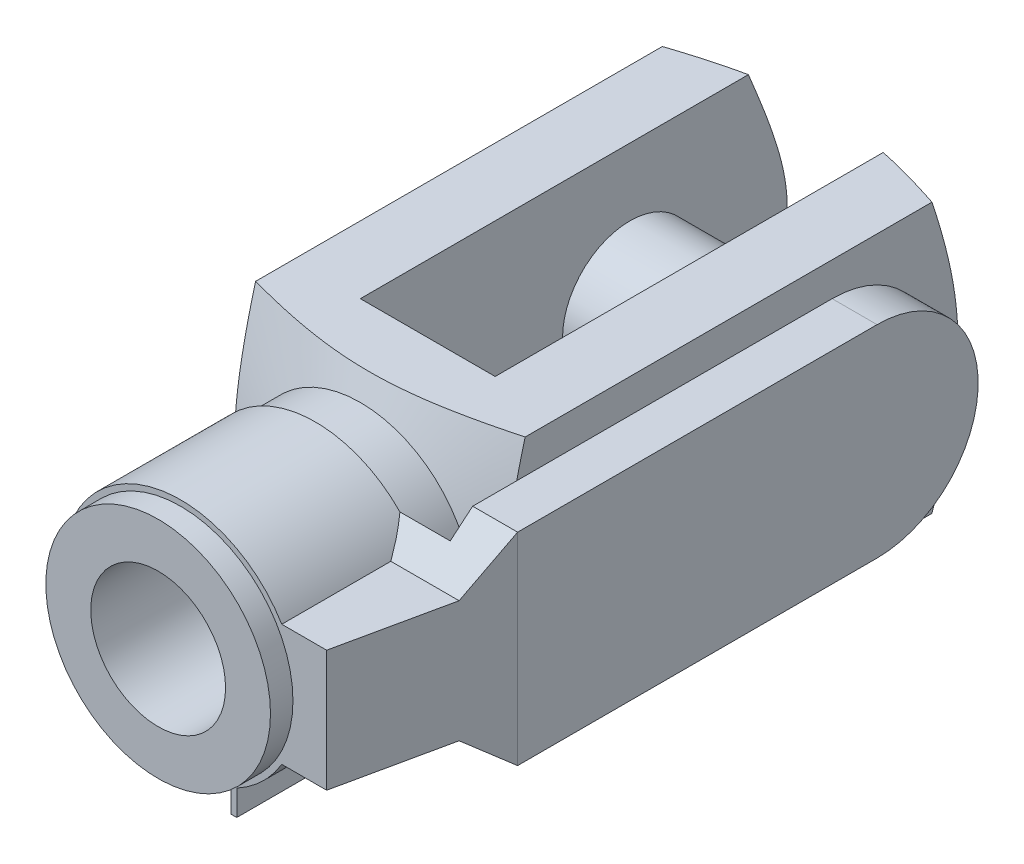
ISO-10303-21;
HEADER;
FILE_DESCRIPTION(('STEP AP214'),'2;1');
FILE_NAME('part.step','',(''),(''),'','','');
FILE_SCHEMA(('AUTOMOTIVE_DESIGN { 1 0 10303 214 1 1 1 1 }'));
ENDSEC;
DATA;
#1=APPLICATION_CONTEXT('core data for automotive mechanical design processes');
#2=APPLICATION_PROTOCOL_DEFINITION('international standard','automotive_design',2000,#1);
#3=PRODUCT_CONTEXT('',#1,'mechanical');
#4=PRODUCT('Part','Part','',(#3));
#5=PRODUCT_RELATED_PRODUCT_CATEGORY('part','',(#4));
#6=PRODUCT_DEFINITION_FORMATION('','',#4);
#7=PRODUCT_DEFINITION_CONTEXT('part definition',#1,'design');
#8=PRODUCT_DEFINITION('design','',#6,#7);
#9=PRODUCT_DEFINITION_SHAPE('','',#8);
#10=(LENGTH_UNIT() NAMED_UNIT(*) SI_UNIT(.MILLI.,.METRE.));
#11=(NAMED_UNIT(*) PLANE_ANGLE_UNIT() SI_UNIT($,.RADIAN.));
#12=(NAMED_UNIT(*) SI_UNIT($,.STERADIAN.) SOLID_ANGLE_UNIT());
#13=UNCERTAINTY_MEASURE_WITH_UNIT(LENGTH_MEASURE(1.E-05),#10,'distance_accuracy_value','');
#14=(GEOMETRIC_REPRESENTATION_CONTEXT(3) GLOBAL_UNCERTAINTY_ASSIGNED_CONTEXT((#13)) GLOBAL_UNIT_ASSIGNED_CONTEXT((#10,
#11,#12)) REPRESENTATION_CONTEXT('',''));
#15=CARTESIAN_POINT('',(0.,0.,0.));
#16=DIRECTION('',(0.,0.,1.));
#17=DIRECTION('',(1.,0.,0.));
#18=AXIS2_PLACEMENT_3D('',#15,#16,#17);
#19=CARTESIAN_POINT('',(6.00000000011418,39.9999999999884,24.0000000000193));
#20=DIRECTION('',(1.,-2.854415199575E-12,0.));
#21=DIRECTION('',(-2.854415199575E-12,-1.,-4.836987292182E-13));
#22=AXIS2_PLACEMENT_3D('',#19,#20,#21);
#23=PLANE('',#22);
#24=DIRECTION('',(2.854415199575E-12,1.,4.836987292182E-13));
#25=VECTOR('',#24,1.);
#26=CARTESIAN_POINT('',(6.00000000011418,39.9999999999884,24.0000000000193));
#27=LINE('',#26,#25);
#28=CARTESIAN_POINT('',(5.99999999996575,-12.0000000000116,23.9999999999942));
#29=VERTEX_POINT('',#28);
#30=CARTESIAN_POINT('',(6.00000000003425,-1.16090144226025E-11,23.9999999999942));
#31=VERTEX_POINT('',#30);
#32=EDGE_CURVE('E146',#29,#31,#27,.T.);
#33=ORIENTED_EDGE('',*,*,#32,.T.);
#34=DIRECTION('',(-2.854415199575E-12,-1.,-4.836987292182E-13));
#35=VECTOR('',#34,1.);
#36=CARTESIAN_POINT('',(6.00000000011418,39.9999999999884,24.0000000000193));
#37=LINE('',#36,#35);
#38=CARTESIAN_POINT('',(6.00000000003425,11.9999999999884,24.0000000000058));
#39=VERTEX_POINT('',#38);
#40=EDGE_CURVE('E149',#39,#31,#37,.T.);
#41=ORIENTED_EDGE('',*,*,#40,.F.);
#42=DIRECTION('',(0.,4.836987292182E-13,-1.));
#43=VECTOR('',#42,1.);
#44=CARTESIAN_POINT('',(6.00000000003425,12.0000000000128,-26.3999999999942));
#45=LINE('',#44,#43);
#46=CARTESIAN_POINT('',(6.00000000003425,11.9999999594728,-10.5416722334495));
#47=VERTEX_POINT('',#46);
#48=EDGE_CURVE('E133',#39,#47,#45,.T.);
#49=ORIENTED_EDGE('',*,*,#48,.T.);
#50=CARTESIAN_POINT('',(5.99999999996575,-11.9999999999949,-10.5416722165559));
#51=CARTESIAN_POINT('',(5.99999999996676,-11.6471429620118,-10.6888012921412));
#52=CARTESIAN_POINT('',(5.99999999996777,-11.293846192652,-10.8348918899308));
#53=CARTESIAN_POINT('',(5.99999999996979,-10.5860738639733,-11.1242897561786));
#54=CARTESIAN_POINT('',(5.9999999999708,-10.2315981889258,-11.2675967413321));
#55=CARTESIAN_POINT('',(5.99999999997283,-9.51989833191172,-11.5512256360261));
#56=CARTESIAN_POINT('',(5.99999999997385,-9.16266882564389,-11.6915342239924));
#57=CARTESIAN_POINT('',(5.99999999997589,-8.44643866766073,-11.967529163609));
#58=CARTESIAN_POINT('',(5.99999999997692,-8.0874380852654,-12.1032156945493));
#59=CARTESIAN_POINT('',(5.99999999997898,-7.36708914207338,-12.3685330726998));
#60=CARTESIAN_POINT('',(5.99999999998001,-7.00574019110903,-12.4981623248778));
#61=CARTESIAN_POINT('',(5.99999999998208,-6.28015184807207,-12.7492558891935));
#62=CARTESIAN_POINT('',(5.99999999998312,-5.91591215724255,-12.8707193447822));
#63=CARTESIAN_POINT('',(5.99999999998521,-5.18431163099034,-13.1023759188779));
#64=CARTESIAN_POINT('',(5.99999999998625,-4.81695499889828,-13.2125822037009));
#65=CARTESIAN_POINT('',(5.99999999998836,-4.07801834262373,-13.4177694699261));
#66=CARTESIAN_POINT('',(5.99999999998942,-3.70643943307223,-13.5127543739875));
#67=CARTESIAN_POINT('',(5.99999999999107,-3.13031971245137,-13.6431872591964));
#68=CARTESIAN_POINT('',(5.99999999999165,-2.92743331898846,-13.685944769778));
#69=CARTESIAN_POINT('',(5.99999999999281,-2.52029299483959,-13.7644256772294));
#70=CARTESIAN_POINT('',(5.99999999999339,-2.31603908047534,-13.800149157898));
#71=CARTESIAN_POINT('',(5.99999999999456,-1.90638054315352,-13.8635516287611));
#72=CARTESIAN_POINT('',(5.99999999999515,-1.70097655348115,-13.8912346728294));
#73=CARTESIAN_POINT('',(5.99999999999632,-1.28916372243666,-13.9376634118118));
#74=CARTESIAN_POINT('',(5.99999999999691,-1.08275495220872,-13.9564097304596));
#75=CARTESIAN_POINT('',(5.99999999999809,-0.669628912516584,-13.9842399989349));
#76=CARTESIAN_POINT('',(5.99999999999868,-0.462912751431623,-13.9933402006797));
#77=CARTESIAN_POINT('',(5.99999999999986,-0.0492803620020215,-14.0015649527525));
#78=CARTESIAN_POINT('',(6.00000000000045,0.157635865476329,-14.0006895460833));
#79=CARTESIAN_POINT('',(6.00000000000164,0.571165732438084,-13.9889999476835));
#80=CARTESIAN_POINT('',(6.00000000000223,0.777779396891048,-13.9781866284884));
#81=CARTESIAN_POINT('',(6.0000000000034,1.19028084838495,-13.9470572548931));
#82=CARTESIAN_POINT('',(6.00000000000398,1.39616863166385,-13.9267411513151));
#83=CARTESIAN_POINT('',(6.00000000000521,1.82450113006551,-13.8752320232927));
#84=CARTESIAN_POINT('',(6.00000000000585,2.04685086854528,-13.8432553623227));
#85=CARTESIAN_POINT('',(6.00000000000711,2.49006139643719,-13.7701695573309));
#86=CARTESIAN_POINT('',(6.00000000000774,2.71092194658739,-13.7290589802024));
#87=CARTESIAN_POINT('',(6.000000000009,3.15117613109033,-13.6389515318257));
#88=CARTESIAN_POINT('',(6.00000000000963,3.37056862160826,-13.589949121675));
#89=CARTESIAN_POINT('',(6.00000000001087,3.80774213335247,-13.485298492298));
#90=CARTESIAN_POINT('',(6.00000000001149,4.02552321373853,-13.429650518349));
#91=CARTESIAN_POINT('',(6.00000000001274,4.46076219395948,-13.3124761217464));
#92=CARTESIAN_POINT('',(6.00000000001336,4.6782118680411,-13.2509193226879));
#93=CARTESIAN_POINT('',(6.0000000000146,5.11173750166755,-13.1231270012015));
#94=CARTESIAN_POINT('',(6.00000000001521,5.32781339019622,-13.0568912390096));
#95=CARTESIAN_POINT('',(6.00000000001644,5.75865135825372,-12.9205593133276));
#96=CARTESIAN_POINT('',(6.00000000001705,5.97341389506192,-12.8504645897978));
#97=CARTESIAN_POINT('',(6.00000000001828,6.40185616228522,-12.7070339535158));
#98=CARTESIAN_POINT('',(6.00000000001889,6.61553586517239,-12.63369795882));
#99=CARTESIAN_POINT('',(6.00000000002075,7.26826940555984,-12.4050598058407));
#100=CARTESIAN_POINT('',(6.000000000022,7.70579064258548,-12.2453832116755));
#101=CARTESIAN_POINT('',(6.00000000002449,8.5778412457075,-11.9180139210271));
#102=CARTESIAN_POINT('',(6.00000000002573,9.01237032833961,-11.7503204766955));
#103=CARTESIAN_POINT('',(6.00000000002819,9.87340594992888,-11.4114050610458));
#104=CARTESIAN_POINT('',(6.0000000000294,10.2999425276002,-11.2402592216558));
#105=CARTESIAN_POINT('',(6.00000000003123,10.9384153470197,-10.9804225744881));
#106=CARTESIAN_POINT('',(6.00000000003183,11.1509931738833,-10.8933009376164));
#107=CARTESIAN_POINT('',(6.00000000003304,11.5757687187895,-10.7181416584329));
#108=CARTESIAN_POINT('',(6.00000000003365,11.7879664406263,-10.6301040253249));
#109=CARTESIAN_POINT('',(6.00000000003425,11.9999999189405,-10.5416722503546));
#110=B_SPLINE_CURVE_WITH_KNOTS('',3,(#50,#51,#52,#53,#54,#55,#56,#57,#58,#59,#60,#61,#62,#63,
#64,#65,#66,#67,#68,#69,#70,#71,#72,#73,#74,#75,#76,#77,#78,#79,#80,#81,#82,#83,#84,#85,#86,#87,
#88,#89,#90,#91,#92,#93,#94,#95,#96,#97,#98,#99,#100,#101,#102,#103,#104,#105,#106,#107,#108,
#109),.UNSPECIFIED.,.F.,.F.,(4,2,2,2,2,2,2,2,2,2,2,2,2,2,2,2,2,2,2,2,2,2,2,2,2,2,2,2,2,4),(0.,
1.14691457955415,2.29394528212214,3.44530904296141,4.59662809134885,5.74824862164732,
6.89998976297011,8.05036802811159,9.20044935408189,9.82237729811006,10.4442978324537,
11.0659042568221,11.6874672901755,12.3079814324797,12.9284928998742,13.5489498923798,
14.1694100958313,14.8431021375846,15.516899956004,16.1911727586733,16.8654206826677,
17.5433422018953,18.2212984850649,18.8990034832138,19.5767256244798,20.9738401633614,
22.371085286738,23.7498277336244,24.4390400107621,25.1282453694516),.UNSPECIFIED.);
#111=CARTESIAN_POINT('',(5.99999999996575,-11.9999999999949,-10.5416722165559));
#112=VERTEX_POINT('',#111);
#113=EDGE_CURVE('E136',#112,#47,#110,.T.);
#114=ORIENTED_EDGE('',*,*,#113,.F.);
#115=DIRECTION('',(0.,4.836987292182E-13,-1.));
#116=VECTOR('',#115,1.);
#117=CARTESIAN_POINT('',(5.99999999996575,-12.0000000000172,35.5999999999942));
#118=LINE('',#117,#116);
#119=EDGE_CURVE('E125',#112,#29,#118,.F.);
#120=ORIENTED_EDGE('',*,*,#119,.T.);
#121=EDGE_LOOP('',(#33,#41,#49,#114,#120));
#122=FACE_BOUND('',#121,.T.);
#123=CARTESIAN_POINT('',(6.,0.,0.));
#124=DIRECTION('',(1.,-2.854415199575E-12,0.));
#125=DIRECTION('',(0.,4.836987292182E-13,-1.));
#126=AXIS2_PLACEMENT_3D('',#123,#124,#125);
#127=CIRCLE('',#126,6.);
#128=CARTESIAN_POINT('',(6.,2.90219237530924E-12,-6.));
#129=VERTEX_POINT('',#128);
#130=EDGE_CURVE('E26',#129,#129,#127,.F.);
#131=ORIENTED_EDGE('',*,*,#130,.F.);
#132=EDGE_LOOP('',(#131));
#133=FACE_BOUND('',#132,.T.);
#134=ADVANCED_FACE('F15',(#122,#133),#23,.F.);
#135=CARTESIAN_POINT('',(-5.99999999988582,40.000000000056,-44.9999999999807));
#136=DIRECTION('',(-1.,2.854415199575E-12,0.));
#137=DIRECTION('',(2.854415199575E-12,1.,4.836987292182E-13));
#138=AXIS2_PLACEMENT_3D('',#135,#136,#137);
#139=PLANE('',#138);
#140=CARTESIAN_POINT('',(-5.99999999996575,12.0000000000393,-10.5416722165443));
#141=CARTESIAN_POINT('',(-5.99999999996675,11.6471429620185,-10.6888012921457));
#142=CARTESIAN_POINT('',(-5.99999999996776,11.2938461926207,-10.8348918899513));
#143=CARTESIAN_POINT('',(-5.99999999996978,10.586073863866,-11.1242897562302));
#144=CARTESIAN_POINT('',(-5.99999999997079,10.2315981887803,-11.267596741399));
#145=CARTESIAN_POINT('',(-5.99999999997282,9.51989833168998,-11.5512256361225));
#146=CARTESIAN_POINT('',(-5.99999999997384,9.16266882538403,-11.6915342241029));
#147=CARTESIAN_POINT('',(-5.99999999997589,8.44643866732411,-11.9675291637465));
#148=CARTESIAN_POINT('',(-5.99999999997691,8.08743808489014,-12.1032156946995));
#149=CARTESIAN_POINT('',(-5.99999999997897,7.36708914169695,-12.3685330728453));
#150=CARTESIAN_POINT('',(-5.99999999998,7.00574019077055,-12.4981623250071));
#151=CARTESIAN_POINT('',(-5.99999999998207,6.28015184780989,-12.7492558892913));
#152=CARTESIAN_POINT('',(-5.99999999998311,5.91591215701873,-12.8707193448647));
#153=CARTESIAN_POINT('',(-5.9999999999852,5.1843116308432,-13.1023759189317));
#154=CARTESIAN_POINT('',(-5.99999999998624,4.81695499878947,-13.2125822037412));
#155=CARTESIAN_POINT('',(-5.99999999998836,4.07801834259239,-13.4177694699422));
#156=CARTESIAN_POINT('',(-5.99999999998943,3.70643943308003,-13.5127543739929));
#157=CARTESIAN_POINT('',(-5.99999999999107,3.13031971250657,-13.6431872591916));
#158=CARTESIAN_POINT('',(-5.99999999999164,2.9274333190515,-13.6859447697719));
#159=CARTESIAN_POINT('',(-5.9999999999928,2.52029299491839,-13.7644256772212));
#160=CARTESIAN_POINT('',(-5.99999999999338,2.31603908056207,-13.800149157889));
#161=CARTESIAN_POINT('',(-5.99999999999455,1.9063805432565,-13.8635516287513));
#162=CARTESIAN_POINT('',(-5.99999999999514,1.70097655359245,-13.8912346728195));
#163=CARTESIAN_POINT('',(-5.99999999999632,1.28916372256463,-13.9376634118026));
#164=CARTESIAN_POINT('',(-5.99999999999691,1.08275495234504,-13.956409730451));
#165=CARTESIAN_POINT('',(-5.99999999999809,0.66962891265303,-13.9842399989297));
#166=CARTESIAN_POINT('',(-5.99999999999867,0.462912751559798,-13.9933402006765));
#167=CARTESIAN_POINT('',(-5.99999999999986,0.0492803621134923,-14.0015649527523));
#168=CARTESIAN_POINT('',(-6.00000000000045,-0.157635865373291,-14.0006895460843));
#169=CARTESIAN_POINT('',(-6.00000000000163,-0.571165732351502,-13.9889999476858));
#170=CARTESIAN_POINT('',(-6.00000000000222,-0.77777939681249,-13.9781866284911));
#171=CARTESIAN_POINT('',(-6.00000000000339,-1.19028084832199,-13.9470572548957));
#172=CARTESIAN_POINT('',(-6.00000000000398,-1.39616863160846,-13.9267411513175));
#173=CARTESIAN_POINT('',(-6.00000000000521,-1.8245011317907,-13.8752320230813));
#174=CARTESIAN_POINT('',(-6.00000000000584,-2.0468508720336,-13.843255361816));
#175=CARTESIAN_POINT('',(-6.0000000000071,-2.49006140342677,-13.7701695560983));
#176=CARTESIAN_POINT('',(-6.00000000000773,-2.7109219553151,-13.7290589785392));
#177=CARTESIAN_POINT('',(-6.00000000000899,-3.15117614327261,-13.6389515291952));
#178=CARTESIAN_POINT('',(-6.00000000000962,-3.37056863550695,-13.5899491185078));
#179=CARTESIAN_POINT('',(-6.00000000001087,-3.80774215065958,-13.4852984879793));
#180=CARTESIAN_POINT('',(-6.00000000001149,-4.02552323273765,-13.4296505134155));
#181=CARTESIAN_POINT('',(-6.00000000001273,-4.46076221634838,-13.3124761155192));
#182=CARTESIAN_POINT('',(-6.00000000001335,-4.67821189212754,-13.2509193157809));
#183=CARTESIAN_POINT('',(-6.00000000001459,-5.11173752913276,-13.1231269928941));
#184=CARTESIAN_POINT('',(-6.0000000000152,-5.32781341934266,-13.0568912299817));
#185=CARTESIAN_POINT('',(-6.00000000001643,-5.75865139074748,-12.9205593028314));
#186=CARTESIAN_POINT('',(-6.00000000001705,-5.9734139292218,-12.8504645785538));
#187=CARTESIAN_POINT('',(-6.00000000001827,-6.40185619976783,-12.707033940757));
#188=CARTESIAN_POINT('',(-6.00000000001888,-6.61553590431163,-12.6336979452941));
#189=CARTESIAN_POINT('',(-6.00000000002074,-7.26826944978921,-12.405059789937));
#190=CARTESIAN_POINT('',(-6.00000000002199,-7.70579069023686,-12.2453831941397));
#191=CARTESIAN_POINT('',(-6.00000000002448,-8.57784130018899,-11.9180139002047));
#192=CARTESIAN_POINT('',(-6.00000000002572,-9.01237038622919,-11.7503204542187));
#193=CARTESIAN_POINT('',(-6.00000000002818,-9.87340601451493,-11.4114050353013));
#194=CARTESIAN_POINT('',(-6.0000000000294,-10.299942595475,-11.2402591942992));
#195=CARTESIAN_POINT('',(-6.00000000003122,-10.9384154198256,-10.9804225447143));
#196=CARTESIAN_POINT('',(-6.00000000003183,-11.1509932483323,-10.8933009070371));
#197=CARTESIAN_POINT('',(-6.00000000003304,-11.5757687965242,-10.7181416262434));
#198=CARTESIAN_POINT('',(-6.00000000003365,-11.7879665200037,-10.6301039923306));
#199=CARTESIAN_POINT('',(-6.00000000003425,-11.9999999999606,-10.5416722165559));
#200=B_SPLINE_CURVE_WITH_KNOTS('',3,(#140,#141,#142,#143,#144,#145,#146,#147,#148,#149,#150,
#151,#152,#153,#154,#155,#156,#157,#158,#159,#160,#161,#162,#163,#164,#165,#166,#167,#168,#169,
#170,#171,#172,#173,#174,#175,#176,#177,#178,#179,#180,#181,#182,#183,#184,#185,#186,#187,#188,
#189,#190,#191,#192,#193,#194,#195,#196,#197,#198,#199),.UNSPECIFIED.,.F.,.F.,(4,2,2,2,2,2,2,2,
2,2,2,2,2,2,2,2,2,2,2,2,2,2,2,2,2,2,2,2,2,4),(0.,1.1469145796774,2.29394528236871,
3.44530904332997,4.59662809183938,5.74824862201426,6.89998976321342,8.05036802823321,
9.20044935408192,9.82237729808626,10.4442978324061,11.0659042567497,11.6874672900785,
12.3079814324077,12.9284928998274,13.5489498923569,14.1694100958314,14.8431021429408,
15.5168999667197,16.1911727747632,16.865420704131,17.5433422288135,18.2212985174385,
18.8990035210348,19.5767256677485,20.9738402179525,22.371085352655,23.7498278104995,
24.4390400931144,25.1282454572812),.UNSPECIFIED.);
#201=CARTESIAN_POINT('',(-5.99999999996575,12.0000000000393,-10.5416722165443));
#202=VERTEX_POINT('',#201);
#203=CARTESIAN_POINT('',(-6.00000000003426,-11.9999999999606,-10.5416722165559));
#204=VERTEX_POINT('',#203);
#205=EDGE_CURVE('E95',#202,#204,#200,.T.);
#206=ORIENTED_EDGE('',*,*,#205,.F.);
#207=DIRECTION('',(0.,4.836987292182E-13,-1.));
#208=VECTOR('',#207,1.);
#209=CARTESIAN_POINT('',(-5.99999999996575,12.000000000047,-26.3999999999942));
#210=LINE('',#209,#208);
#211=CARTESIAN_POINT('',(-5.99999999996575,12.0000000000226,24.0000000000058));
#212=VERTEX_POINT('',#211);
#213=EDGE_CURVE('E138',#202,#212,#210,.F.);
#214=ORIENTED_EDGE('',*,*,#213,.T.);
#215=DIRECTION('',(2.854415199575E-12,1.,4.836987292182E-13));
#216=VECTOR('',#215,1.);
#217=CARTESIAN_POINT('',(-5.99999999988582,40.0000000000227,24.0000000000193));
#218=LINE('',#217,#216);
#219=CARTESIAN_POINT('',(-6.,2.26436005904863E-11,24.));
#220=VERTEX_POINT('',#219);
#221=EDGE_CURVE('E106',#220,#212,#218,.T.);
#222=ORIENTED_EDGE('',*,*,#221,.F.);
#223=DIRECTION('',(2.854415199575E-12,1.,4.836987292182E-13));
#224=VECTOR('',#223,1.);
#225=CARTESIAN_POINT('',(-5.99999999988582,40.0000000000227,24.0000000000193));
#226=LINE('',#225,#224);
#227=CARTESIAN_POINT('',(-6.00000000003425,-11.9999999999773,23.9999999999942));
#228=VERTEX_POINT('',#227);
#229=EDGE_CURVE('E122',#228,#220,#226,.T.);
#230=ORIENTED_EDGE('',*,*,#229,.F.);
#231=DIRECTION('',(0.,4.836987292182E-13,-1.));
#232=VECTOR('',#231,1.);
#233=CARTESIAN_POINT('',(-6.00000000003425,-11.999999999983,35.5999999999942));
#234=LINE('',#233,#232);
#235=EDGE_CURVE('E113',#228,#204,#234,.T.);
#236=ORIENTED_EDGE('',*,*,#235,.T.);
#237=EDGE_LOOP('',(#206,#214,#222,#230,#236));
#238=FACE_BOUND('',#237,.T.);
#239=CARTESIAN_POINT('',(-6.,3.42529823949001E-11,0.));
#240=DIRECTION('',(-1.,2.854415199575E-12,0.));
#241=DIRECTION('',(0.,-4.836987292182E-13,1.));
#242=AXIS2_PLACEMENT_3D('',#239,#240,#241);
#243=CIRCLE('',#242,6.);
#244=CARTESIAN_POINT('',(-6.,3.13507900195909E-11,6.));
#245=VERTEX_POINT('',#244);
#246=EDGE_CURVE('E375',#245,#245,#243,.F.);
#247=ORIENTED_EDGE('',*,*,#246,.F.);
#248=EDGE_LOOP('',(#247));
#249=FACE_BOUND('',#248,.T.);
#250=ADVANCED_FACE('F118',(#238,#249),#139,.F.);
#251=CARTESIAN_POINT('',(0.,2.14083774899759E-11,-8.8536486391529));
#252=DIRECTION('',(0.,-4.836987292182E-13,1.));
#253=DIRECTION('',(1.,-2.854415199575E-12,0.));
#254=AXIS2_PLACEMENT_3D('',#251,#252,#253);
#255=CONICAL_SURFACE('',#254,17.0363861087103,1.13446401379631);
#256=CARTESIAN_POINT('',(-11.9999999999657,12.0000000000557,-8.8843425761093));
#257=CARTESIAN_POINT('',(-11.7534953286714,12.000000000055,-8.96561852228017));
#258=CARTESIAN_POINT('',(-11.5066205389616,12.0000000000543,-9.04577252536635));
#259=CARTESIAN_POINT('',(-11.0120628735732,12.000000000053,-9.20357137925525));
#260=CARTESIAN_POINT('',(-10.7643799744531,12.0000000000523,-9.28121615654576));
#261=CARTESIAN_POINT('',(-10.0204408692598,12.0000000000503,-9.50985816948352));
#262=CARTESIAN_POINT('',(-9.5228951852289,12.000000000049,-9.65669559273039));
#263=CARTESIAN_POINT('',(-8.52379223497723,12.0000000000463,-9.93669330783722));
#264=CARTESIAN_POINT('',(-8.02223395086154,12.0000000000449,-10.0698500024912));
#265=CARTESIAN_POINT('',(-7.26656094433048,12.0000000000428,-10.2569377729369));
#266=CARTESIAN_POINT('',(-7.01401342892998,12.0000000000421,-10.3172138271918));
#267=CARTESIAN_POINT('',(-6.50782719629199,12.0000000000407,-10.4330759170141));
#268=CARTESIAN_POINT('',(-6.25418840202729,12.00000000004,-10.4886616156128));
#269=CARTESIAN_POINT('',(-5.99999999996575,12.0000000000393,-10.5416722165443));
#270=B_SPLINE_CURVE_WITH_KNOTS('',3,(#256,#257,#258,#259,#260,#261,#262,#263,#264,#265,#266,
#267,#268,#269),.UNSPECIFIED.,.F.,.F.,(4,2,2,2,2,2,4),(0.,0.778670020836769,1.55736283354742,
3.1134872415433,4.67001977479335,5.44890262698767,6.22784138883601),.UNSPECIFIED.);
#271=CARTESIAN_POINT('',(-11.9999999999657,12.0000000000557,-8.8843425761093));
#272=VERTEX_POINT('',#271);
#273=EDGE_CURVE('E100',#272,#202,#270,.T.);
#274=ORIENTED_EDGE('',*,*,#273,.T.);
#275=ORIENTED_EDGE('',*,*,#205,.T.);
#276=CARTESIAN_POINT('',(-6.00000000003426,-11.9999999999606,-10.5416722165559));
#277=CARTESIAN_POINT('',(-6.25418840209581,-11.9999999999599,-10.4886616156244));
#278=CARTESIAN_POINT('',(-6.5078271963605,-11.9999999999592,-10.4330759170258));
#279=CARTESIAN_POINT('',(-7.01401342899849,-11.9999999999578,-10.3172138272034));
#280=CARTESIAN_POINT('',(-7.266560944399,-11.9999999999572,-10.2569377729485));
#281=CARTESIAN_POINT('',(-8.02223395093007,-11.9999999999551,-10.0698500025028));
#282=CARTESIAN_POINT('',(-8.52379223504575,-11.9999999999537,-9.93669330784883));
#283=CARTESIAN_POINT('',(-9.52289518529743,-11.999999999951,-9.656695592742));
#284=CARTESIAN_POINT('',(-10.0204408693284,-11.9999999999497,-9.50985816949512));
#285=CARTESIAN_POINT('',(-10.7643799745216,-11.9999999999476,-9.28121615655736));
#286=CARTESIAN_POINT('',(-11.0120628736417,-11.999999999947,-9.20357137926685));
#287=CARTESIAN_POINT('',(-11.5066205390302,-11.9999999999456,-9.04577252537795));
#288=CARTESIAN_POINT('',(-11.7534953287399,-11.999999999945,-8.96561852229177));
#289=CARTESIAN_POINT('',(-12.0000000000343,-11.9999999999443,-8.8843425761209));
#290=B_SPLINE_CURVE_WITH_KNOTS('',3,(#276,#277,#278,#279,#280,#281,#282,#283,#284,#285,#286,
#287,#288,#289),.UNSPECIFIED.,.F.,.F.,(4,2,2,2,2,2,4),(0.,0.778938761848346,1.55782161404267,
3.11435414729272,4.67047855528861,5.44917136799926,6.22784138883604),.UNSPECIFIED.);
#291=CARTESIAN_POINT('',(-12.0000000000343,-11.9999999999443,-8.8843425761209));
#292=VERTEX_POINT('',#291);
#293=EDGE_CURVE('E98',#204,#292,#290,.T.);
#294=ORIENTED_EDGE('',*,*,#293,.T.);
#295=CARTESIAN_POINT('',(-12.0000000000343,-11.9999999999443,-8.8843425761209));
#296=CARTESIAN_POINT('',(-12.0000000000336,-11.7615514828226,-8.96296266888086));
#297=CARTESIAN_POINT('',(-12.0000000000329,-11.5227570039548,-9.04053231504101));
#298=CARTESIAN_POINT('',(-12.0000000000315,-11.044412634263,-9.19333234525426));
#299=CARTESIAN_POINT('',(-12.0000000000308,-10.8048627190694,-9.26856265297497));
#300=CARTESIAN_POINT('',(-12.0000000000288,-10.084824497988,-9.49043591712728));
#301=CARTESIAN_POINT('',(-12.0000000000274,-9.60312991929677,-9.63320074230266));
#302=CARTESIAN_POINT('',(-12.0000000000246,-8.63271726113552,-9.90699968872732));
#303=CARTESIAN_POINT('',(-12.0000000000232,-8.14397360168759,-10.0379436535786));
#304=CARTESIAN_POINT('',(-12.0000000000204,-7.16253980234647,-10.2840294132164));
#305=CARTESIAN_POINT('',(-12.000000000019,-6.66985006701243,-10.3991728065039));
#306=CARTESIAN_POINT('',(-12.0000000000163,-5.69773118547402,-10.6065852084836));
#307=CARTESIAN_POINT('',(-12.0000000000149,-5.21844460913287,-10.6995159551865));
#308=CARTESIAN_POINT('',(-12.0000000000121,-4.25621361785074,-10.8642713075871));
#309=CARTESIAN_POINT('',(-12.0000000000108,-3.77326922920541,-10.9360960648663));
#310=CARTESIAN_POINT('',(-12.000000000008,-2.80602754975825,-11.0553056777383));
#311=CARTESIAN_POINT('',(-12.0000000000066,-2.32174075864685,-11.1027744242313));
#312=CARTESIAN_POINT('',(-12.0000000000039,-1.35128490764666,-11.1712295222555));
#313=CARTESIAN_POINT('',(-12.0000000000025,-0.865115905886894,-11.1922166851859));
#314=CARTESIAN_POINT('',(-11.9999999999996,0.138040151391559,-11.2069657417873));
#315=CARTESIAN_POINT('',(-11.9999999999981,0.655054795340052,-11.198944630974));
#316=CARTESIAN_POINT('',(-11.9999999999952,1.68768885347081,-11.152171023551));
#317=CARTESIAN_POINT('',(-11.9999999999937,2.20330818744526,-11.1134167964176));
#318=CARTESIAN_POINT('',(-11.9999999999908,3.23350509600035,-11.0073263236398));
#319=CARTESIAN_POINT('',(-11.9999999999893,3.74807146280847,-10.939883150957));
#320=CARTESIAN_POINT('',(-11.9999999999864,4.77324147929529,-10.7799425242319));
#321=CARTESIAN_POINT('',(-11.9999999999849,5.28384506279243,-10.6874446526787));
#322=CARTESIAN_POINT('',(-11.999999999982,6.32030071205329,-10.4773572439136));
#323=CARTESIAN_POINT('',(-11.9999999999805,6.84598274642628,-10.3589385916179));
#324=CARTESIAN_POINT('',(-11.9999999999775,7.89282563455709,-10.1034858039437));
#325=CARTESIAN_POINT('',(-11.999999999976,8.41398589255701,-9.96644925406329));
#326=CARTESIAN_POINT('',(-11.999999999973,9.44815672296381,-9.67848855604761));
#327=CARTESIAN_POINT('',(-11.9999999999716,9.96119913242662,-9.5276779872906));
#328=CARTESIAN_POINT('',(-11.9999999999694,10.7278813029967,-9.29260310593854));
#329=CARTESIAN_POINT('',(-11.9999999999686,10.9828998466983,-9.21278888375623));
#330=CARTESIAN_POINT('',(-11.9999999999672,11.492076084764,-9.05049346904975));
#331=CARTESIAN_POINT('',(-11.9999999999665,11.7462338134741,-8.96801238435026));
#332=CARTESIAN_POINT('',(-11.9999999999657,12.0000000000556,-8.8843425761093));
#333=B_SPLINE_CURVE_WITH_KNOTS('',3,(#295,#296,#297,#298,#299,#300,#301,#302,#303,#304,#305,
#306,#307,#308,#309,#310,#311,#312,#313,#314,#315,#316,#317,#318,#319,#320,#321,#322,#323,#324,
#325,#326,#327,#328,#329,#330,#331,#332),.UNSPECIFIED.,.F.,.F.,(4,2,2,2,2,2,2,2,2,2,2,2,2,2,2,2,
2,2,4),(0.,0.753221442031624,1.50646743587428,3.01353524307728,4.53126725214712,
6.04884560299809,7.51308460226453,8.97731308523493,10.4364637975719,11.8955698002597,
13.4458427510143,14.9962030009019,16.5523929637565,18.1086088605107,19.7247556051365,
21.3411121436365,22.945172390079,23.7468109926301,24.5484172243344),.UNSPECIFIED.);
#334=EDGE_CURVE('E229',#292,#272,#333,.T.);
#335=ORIENTED_EDGE('',*,*,#334,.T.);
#336=EDGE_LOOP('',(#274,#275,#294,#335));
#337=FACE_BOUND('',#336,.T.);
#338=ADVANCED_FACE('F97',(#337),#255,.T.);
#339=CARTESIAN_POINT('',(12.0000000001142,40.0000000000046,-44.9999999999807));
#340=DIRECTION('',(-1.,2.854415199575E-12,0.));
#341=DIRECTION('',(2.854415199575E-12,1.,4.836987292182E-13));
#342=AXIS2_PLACEMENT_3D('',#339,#340,#341);
#343=PLANE('',#342);
#344=DIRECTION('',(0.,4.836987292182E-13,-1.));
#345=VECTOR('',#344,1.);
#346=CARTESIAN_POINT('',(11.9999999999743,-9.00000000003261,31.9999999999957));
#347=LINE('',#346,#345);
#348=CARTESIAN_POINT('',(11.9999999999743,-9.00000000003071,28.0806798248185));
#349=VERTEX_POINT('',#348);
#350=CARTESIAN_POINT('',(11.9999999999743,-9.00000000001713,-4.39925873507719E-12));
#351=VERTEX_POINT('',#350);
#352=EDGE_CURVE('E413',#349,#351,#347,.T.);
#353=ORIENTED_EDGE('',*,*,#352,.F.);
#354=CARTESIAN_POINT('',(11.9999999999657,-12.0000000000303,27.3242516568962));
#355=CARTESIAN_POINT('',(11.9999999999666,-11.7134936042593,27.4020115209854));
#356=CARTESIAN_POINT('',(11.9999999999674,-11.426635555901,27.4784887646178));
#357=CARTESIAN_POINT('',(11.999999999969,-10.8521449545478,27.6285250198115));
#358=CARTESIAN_POINT('',(11.9999999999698,-10.5645123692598,27.7020839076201));
#359=CARTESIAN_POINT('',(11.9999999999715,-9.98826797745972,27.8459632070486));
#360=CARTESIAN_POINT('',(11.9999999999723,-9.69965572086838,27.9162818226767));
#361=CARTESIAN_POINT('',(11.999999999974,-9.12156037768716,28.0532202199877));
#362=CARTESIAN_POINT('',(11.9999999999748,-8.83207730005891,28.1198400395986));
#363=CARTESIAN_POINT('',(11.9999999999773,-7.95916037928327,28.3141659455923));
#364=CARTESIAN_POINT('',(11.999999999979,-7.37429741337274,28.4355699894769));
#365=CARTESIAN_POINT('',(11.9999999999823,-6.20064756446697,28.6573664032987));
#366=CARTESIAN_POINT('',(11.999999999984,-5.61186125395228,28.7577617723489));
#367=CARTESIAN_POINT('',(11.9999999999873,-4.44683234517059,28.9303687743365));
#368=CARTESIAN_POINT('',(11.999999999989,-3.87069716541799,29.0032875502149));
#369=CARTESIAN_POINT('',(11.9999999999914,-3.00434377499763,29.0913059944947));
#370=CARTESIAN_POINT('',(11.9999999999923,-2.71519009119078,29.1170860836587));
#371=CARTESIAN_POINT('',(11.9999999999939,-2.1363139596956,29.1611123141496));
#372=CARTESIAN_POINT('',(11.9999999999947,-1.84659153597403,29.1793587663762));
#373=CARTESIAN_POINT('',(11.9999999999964,-1.26750836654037,29.2079553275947));
#374=CARTESIAN_POINT('',(11.9999999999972,-0.978148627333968,29.2183257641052));
#375=CARTESIAN_POINT('',(11.9999999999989,-0.399262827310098,29.2310578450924));
#376=CARTESIAN_POINT('',(11.9999999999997,-0.10973677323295,29.2334197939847));
#377=CARTESIAN_POINT('',(12.0000000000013,0.469266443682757,29.2300903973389));
#378=CARTESIAN_POINT('',(12.0000000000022,0.758743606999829,29.2243991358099));
#379=CARTESIAN_POINT('',(12.0000000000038,1.33742362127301,29.205072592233));
#380=CARTESIAN_POINT('',(12.0000000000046,1.62662647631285,29.1914374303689));
#381=CARTESIAN_POINT('',(12.0000000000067,2.33807462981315,29.1483825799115));
#382=CARTESIAN_POINT('',(12.0000000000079,2.7600598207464,29.1145808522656));
#383=CARTESIAN_POINT('',(12.0000000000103,3.60248424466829,29.0317186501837));
#384=CARTESIAN_POINT('',(12.0000000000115,4.0229235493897,28.982658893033));
#385=CARTESIAN_POINT('',(12.0000000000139,4.86268493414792,28.8707466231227));
#386=CARTESIAN_POINT('',(12.0000000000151,5.2820038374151,28.8078704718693));
#387=CARTESIAN_POINT('',(12.0000000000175,6.11864468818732,28.6700713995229));
#388=CARTESIAN_POINT('',(12.0000000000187,6.53596661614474,28.5951483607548));
#389=CARTESIAN_POINT('',(12.0000000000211,7.37753487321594,28.4332052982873));
#390=CARTESIAN_POINT('',(12.0000000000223,7.8017376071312,28.3459601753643));
#391=CARTESIAN_POINT('',(12.0000000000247,8.64815157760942,28.1622698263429));
#392=CARTESIAN_POINT('',(12.0000000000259,9.07036274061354,28.065824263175));
#393=CARTESIAN_POINT('',(12.0000000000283,9.91146426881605,27.865532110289));
#394=CARTESIAN_POINT('',(12.0000000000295,10.3303610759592,27.7617124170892));
#395=CARTESIAN_POINT('',(12.0000000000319,11.1664201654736,27.5475691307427));
#396=CARTESIAN_POINT('',(12.0000000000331,11.5835827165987,27.4372465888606));
#397=CARTESIAN_POINT('',(12.0000000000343,11.9999999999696,27.3242516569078));
#398=B_SPLINE_CURVE_WITH_KNOTS('',3,(#354,#355,#356,#357,#358,#359,#360,#361,#362,#363,#364,
#365,#366,#367,#368,#369,#370,#371,#372,#373,#374,#375,#376,#377,#378,#379,#380,#381,#382,#383,
#384,#385,#386,#387,#388,#389,#390,#391,#392,#393,#394,#395,#396,#397),.UNSPECIFIED.,.F.,.F.,(4,
2,2,2,2,2,2,2,2,2,2,2,2,2,2,2,2,2,2,2,2,4),(0.,0.890615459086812,1.78126864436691,
2.67240969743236,3.56354161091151,5.35520514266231,7.14661272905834,8.88812209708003,
9.75894149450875,10.6297249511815,11.4982532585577,12.366748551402,13.2352347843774,
14.1037078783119,15.3733967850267,16.6430260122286,17.9148446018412,19.1866756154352,
20.4858004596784,21.7849729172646,23.0796286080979,24.3740755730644),.UNSPECIFIED.);
#399=CARTESIAN_POINT('',(11.9999999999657,-12.0000000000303,27.3242516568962));
#400=VERTEX_POINT('',#399);
#401=EDGE_CURVE('E171',#400,#349,#398,.T.);
#402=ORIENTED_EDGE('',*,*,#401,.F.);
#403=DIRECTION('',(0.,4.836987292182E-13,-1.));
#404=VECTOR('',#403,1.);
#405=CARTESIAN_POINT('',(11.9999999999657,-11.9999999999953,-45.0000000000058));
#406=LINE('',#405,#404);
#407=CARTESIAN_POINT('',(11.9999999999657,-12.0000000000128,-8.8843425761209));
#408=VERTEX_POINT('',#407);
#409=EDGE_CURVE('E169',#408,#400,#406,.F.);
#410=ORIENTED_EDGE('',*,*,#409,.F.);
#411=CARTESIAN_POINT('',(12.0000000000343,11.999999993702,-8.88434257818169));
#412=CARTESIAN_POINT('',(12.0000000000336,11.7615514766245,-8.96296267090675));
#413=CARTESIAN_POINT('',(12.0000000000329,11.5227569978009,-9.0405323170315));
#414=CARTESIAN_POINT('',(12.0000000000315,11.0444126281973,-9.19333234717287));
#415=CARTESIAN_POINT('',(12.0000000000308,10.8048627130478,-9.26856265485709));
#416=CARTESIAN_POINT('',(12.0000000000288,10.0848244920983,-9.49043591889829));
#417=CARTESIAN_POINT('',(12.0000000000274,9.60312991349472,-9.63320074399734));
#418=CARTESIAN_POINT('',(12.0000000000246,8.63271725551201,-9.90699969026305));
#419=CARTESIAN_POINT('',(12.0000000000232,8.14397359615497,-10.0379436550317));
#420=CARTESIAN_POINT('',(12.0000000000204,7.1625397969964,-10.2840294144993));
#421=CARTESIAN_POINT('',(12.000000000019,6.66985006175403,-10.3991728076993));
#422=CARTESIAN_POINT('',(12.0000000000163,5.69773118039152,-10.6065852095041));
#423=CARTESIAN_POINT('',(12.0000000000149,5.21844460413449,-10.6995159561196));
#424=CARTESIAN_POINT('',(12.0000000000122,4.25621361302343,-10.8642713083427));
#425=CARTESIAN_POINT('',(12.0000000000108,3.77326922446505,-10.9360960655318));
#426=CARTESIAN_POINT('',(12.000000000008,2.80602754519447,-11.0553056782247));
#427=CARTESIAN_POINT('',(12.0000000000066,2.32174075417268,-11.1027744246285));
#428=CARTESIAN_POINT('',(12.0000000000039,1.35128490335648,-11.1712295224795));
#429=CARTESIAN_POINT('',(12.0000000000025,0.865115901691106,-11.1922166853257));
#430=CARTESIAN_POINT('',(11.9999999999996,-0.138040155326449,-11.2069657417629));
#431=CARTESIAN_POINT('',(11.9999999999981,-0.655054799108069,-11.198944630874));
#432=CARTESIAN_POINT('',(11.9999999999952,-1.68768885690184,-11.1521710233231));
#433=CARTESIAN_POINT('',(11.9999999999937,-2.20330819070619,-11.1134167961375));
#434=CARTESIAN_POINT('',(11.9999999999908,-3.23350509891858,-11.0073263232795));
#435=CARTESIAN_POINT('',(11.9999999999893,-3.74807146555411,-10.939883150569));
#436=CARTESIAN_POINT('',(11.9999999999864,-4.77324148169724,-10.7799425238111));
#437=CARTESIAN_POINT('',(11.9999999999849,-5.28384506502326,-10.687444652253));
#438=CARTESIAN_POINT('',(11.999999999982,-6.32030071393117,-10.4773572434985));
#439=CARTESIAN_POINT('',(11.9999999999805,-6.8459827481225,-10.3589385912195));
#440=CARTESIAN_POINT('',(11.9999999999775,-7.89282563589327,-10.103485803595));
#441=CARTESIAN_POINT('',(11.999999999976,-8.41398589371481,-9.96644925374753));
#442=CARTESIAN_POINT('',(11.999999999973,-9.44815672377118,-9.67848855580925));
#443=CARTESIAN_POINT('',(11.9999999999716,-9.96119913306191,-9.52767798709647));
#444=CARTESIAN_POINT('',(11.9999999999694,-10.7278813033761,-9.29260310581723));
#445=CARTESIAN_POINT('',(11.9999999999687,-10.9828998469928,-9.21278888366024));
#446=CARTESIAN_POINT('',(11.9999999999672,-11.4920760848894,-9.05049346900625));
#447=CARTESIAN_POINT('',(11.9999999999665,-11.7462338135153,-8.96801238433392));
#448=CARTESIAN_POINT('',(11.9999999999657,-12.0000000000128,-8.8843425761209));
#449=B_SPLINE_CURVE_WITH_KNOTS('',3,(#411,#412,#413,#414,#415,#416,#417,#418,#419,#420,#421,
#422,#423,#424,#425,#426,#427,#428,#429,#430,#431,#432,#433,#434,#435,#436,#437,#438,#439,#440,
#441,#442,#443,#444,#445,#446,#447,#448),.UNSPECIFIED.,.F.,.F.,(4,2,2,2,2,2,2,2,2,2,2,2,2,2,2,2,
2,2,4),(0.,0.753221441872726,1.5064674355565,3.01353524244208,4.53126725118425,6.04884560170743,
7.51308460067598,8.97731308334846,10.4364637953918,11.8955697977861,13.4458427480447,
14.9962029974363,16.5523929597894,18.1086088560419,19.7247556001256,21.3411121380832,
22.9451723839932,23.7468109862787,24.5484172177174),.UNSPECIFIED.);
#450=CARTESIAN_POINT('',(11.9999999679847,11.9999999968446,-8.88434258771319));
#451=VERTEX_POINT('',#450);
#452=EDGE_CURVE('E160',#451,#408,#449,.T.);
#453=ORIENTED_EDGE('',*,*,#452,.F.);
#454=DIRECTION('',(0.,4.836987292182E-13,-1.));
#455=VECTOR('',#454,1.);
#456=CARTESIAN_POINT('',(12.0000000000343,12.0000000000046,-44.9999999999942));
#457=LINE('',#456,#455);
#458=CARTESIAN_POINT('',(12.0000000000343,11.9999999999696,27.3242516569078));
#459=VERTEX_POINT('',#458);
#460=EDGE_CURVE('E170',#459,#451,#457,.T.);
#461=ORIENTED_EDGE('',*,*,#460,.F.);
#462=CARTESIAN_POINT('',(12.0000000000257,8.99999999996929,28.0806798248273));
#463=VERTEX_POINT('',#462);
#464=EDGE_CURVE('E369',#463,#459,#398,.T.);
#465=ORIENTED_EDGE('',*,*,#464,.F.);
#466=DIRECTION('',(0.,4.836987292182E-13,-1.));
#467=VECTOR('',#466,1.);
#468=CARTESIAN_POINT('',(12.0000000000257,8.9999999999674,32.0000000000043));
#469=LINE('',#468,#467);
#470=CARTESIAN_POINT('',(12.0000000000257,8.99999999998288,4.30211422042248E-12));
#471=VERTEX_POINT('',#470);
#472=EDGE_CURVE('E400',#471,#463,#469,.F.);
#473=ORIENTED_EDGE('',*,*,#472,.F.);
#474=CARTESIAN_POINT('',(12.,-1.712649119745E-11,0.));
#475=DIRECTION('',(-1.,2.854415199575E-12,0.));
#476=DIRECTION('',(2.854415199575E-12,1.,4.836987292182E-13));
#477=AXIS2_PLACEMENT_3D('',#474,#475,#476);
#478=CIRCLE('',#477,9.);
#479=EDGE_CURVE('E405',#351,#471,#478,.F.);
#480=ORIENTED_EDGE('',*,*,#479,.F.);
#481=EDGE_LOOP('',(#353,#402,#410,#453,#461,#465,#473,#480));
#482=FACE_BOUND('',#481,.T.);
#483=ADVANCED_FACE('F178',(#482),#343,.F.);
#484=CARTESIAN_POINT('',(-40.0000000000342,-11.9999999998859,35.5999999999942));
#485=DIRECTION('',(2.854415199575E-12,1.,4.836987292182E-13));
#486=DIRECTION('',(1.,-2.854415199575E-12,0.));
#487=AXIS2_PLACEMENT_3D('',#484,#485,#486);
#488=PLANE('',#487);
#489=CARTESIAN_POINT('',(-11.999999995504,-11.9999999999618,27.3242516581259));
#490=CARTESIAN_POINT('',(-11.7526834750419,-11.9999999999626,27.3913785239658));
#491=CARTESIAN_POINT('',(-11.5051065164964,-11.9999999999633,27.4575447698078));
#492=CARTESIAN_POINT('',(-11.0093842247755,-11.9999999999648,27.5877375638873));
#493=CARTESIAN_POINT('',(-10.7612388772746,-11.9999999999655,27.6517640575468));
#494=CARTESIAN_POINT('',(-10.0157528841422,-11.9999999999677,27.840337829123));
#495=CARTESIAN_POINT('',(-9.51750662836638,-11.9999999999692,27.9613399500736));
#496=CARTESIAN_POINT('',(-8.51590347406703,-11.9999999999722,28.1923201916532));
#497=CARTESIAN_POINT('',(-8.01253350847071,-11.9999999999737,28.3022419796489));
#498=CARTESIAN_POINT('',(-7.00289778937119,-11.9999999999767,28.5077999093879));
#499=CARTESIAN_POINT('',(-6.49663226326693,-11.9999999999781,28.6034371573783));
#500=CARTESIAN_POINT('',(-5.49378557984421,-11.9999999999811,28.7753360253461));
#501=CARTESIAN_POINT('',(-4.99727782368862,-11.9999999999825,28.8520214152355));
#502=CARTESIAN_POINT('',(-4.00164235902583,-11.9999999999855,28.9861975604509));
#503=CARTESIAN_POINT('',(-3.50251466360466,-11.9999999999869,29.0436884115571));
#504=CARTESIAN_POINT('',(-2.5033827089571,-11.9999999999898,29.1367712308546));
#505=CARTESIAN_POINT('',(-2.00338333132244,-11.9999999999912,29.1724147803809));
#506=CARTESIAN_POINT('',(-1.00225594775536,-11.9999999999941,29.2201647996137));
#507=CARTESIAN_POINT('',(-0.501127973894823,-11.9999999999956,29.2322719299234));
#508=CARTESIAN_POINT('',(0.501127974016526,-11.9999999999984,29.2322719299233));
#509=CARTESIAN_POINT('',(1.00225594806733,-11.9999999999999,29.2201647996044));
#510=CARTESIAN_POINT('',(2.00338333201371,-12.0000000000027,29.1724147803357));
#511=CARTESIAN_POINT('',(2.50338270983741,-12.0000000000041,29.1367712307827));
#512=CARTESIAN_POINT('',(3.50251466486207,-12.0000000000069,29.0436884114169));
#513=CARTESIAN_POINT('',(4.0016423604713,-12.0000000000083,28.9861975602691));
#514=CARTESIAN_POINT('',(4.99727782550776,-12.0000000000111,28.8520214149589));
#515=CARTESIAN_POINT('',(5.49378558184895,-12.0000000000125,28.7753360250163));
#516=CARTESIAN_POINT('',(6.49663226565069,-12.0000000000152,28.6034371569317));
#517=CARTESIAN_POINT('',(7.00289779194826,-12.0000000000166,28.5077999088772));
#518=CARTESIAN_POINT('',(8.01253351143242,-12.0000000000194,28.3022419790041));
#519=CARTESIAN_POINT('',(8.51590347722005,-12.0000000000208,28.1923201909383));
#520=CARTESIAN_POINT('',(9.51750663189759,-12.0000000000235,27.9613399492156));
#521=CARTESIAN_POINT('',(10.0157528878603,-12.0000000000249,27.8403378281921));
#522=CARTESIAN_POINT('',(10.7612388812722,-12.0000000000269,27.6517640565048));
#523=CARTESIAN_POINT('',(11.0093842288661,-12.0000000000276,27.5877375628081));
#524=CARTESIAN_POINT('',(11.5051065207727,-12.000000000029,27.4575447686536));
#525=CARTESIAN_POINT('',(11.752683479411,-12.0000000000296,27.3913785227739));
#526=CARTESIAN_POINT('',(11.9999999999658,-12.0000000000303,27.3242516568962));
#527=B_SPLINE_CURVE_WITH_KNOTS('',3,(#489,#490,#491,#492,#493,#494,#495,#496,#497,#498,#499,
#500,#501,#502,#503,#504,#505,#506,#507,#508,#509,#510,#511,#512,#513,#514,#515,#516,#517,#518,
#519,#520,#521,#522,#523,#524,#525,#526),.UNSPECIFIED.,.F.,.F.,(4,2,2,2,2,2,2,2,2,2,2,2,2,2,2,2,
2,2,4),(0.,0.768789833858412,1.53759926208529,3.0756669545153,4.62119679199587,6.16660687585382,
7.67347142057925,9.1803284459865,10.6836139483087,12.1868572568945,13.6901005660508,
15.1933860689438,16.7002430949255,18.2071076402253,19.7525177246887,21.2980475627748,
22.8361152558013,23.6049246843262,24.3737145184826),.UNSPECIFIED.);
#528=CARTESIAN_POINT('',(-11.9999999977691,-11.9999999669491,27.3242516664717));
#529=VERTEX_POINT('',#528);
#530=EDGE_CURVE('E213',#529,#400,#527,.T.);
#531=ORIENTED_EDGE('',*,*,#530,.F.);
#532=DIRECTION('',(0.,4.836987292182E-13,-1.));
#533=VECTOR('',#532,1.);
#534=CARTESIAN_POINT('',(-12.0000000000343,-11.9999999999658,35.5999999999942));
#535=LINE('',#534,#533);
#536=EDGE_CURVE('E116',#292,#529,#535,.F.);
#537=ORIENTED_EDGE('',*,*,#536,.F.);
#538=ORIENTED_EDGE('',*,*,#293,.F.);
#539=ORIENTED_EDGE('',*,*,#235,.F.);
#540=DIRECTION('',(1.,-2.854415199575E-12,0.));
#541=VECTOR('',#540,1.);
#542=CARTESIAN_POINT('',(-40.0000000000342,-11.9999999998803,23.9999999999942));
#543=LINE('',#542,#541);
#544=EDGE_CURVE('E123',#29,#228,#543,.F.);
#545=ORIENTED_EDGE('',*,*,#544,.F.);
#546=ORIENTED_EDGE('',*,*,#119,.F.);
#547=CARTESIAN_POINT('',(11.9999999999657,-12.0000000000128,-8.8843425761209));
#548=CARTESIAN_POINT('',(11.7534953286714,-12.0000000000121,-8.96561852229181));
#549=CARTESIAN_POINT('',(11.5066205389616,-12.0000000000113,-9.04577252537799));
#550=CARTESIAN_POINT('',(11.0120628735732,-12.0000000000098,-9.2035713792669));
#551=CARTESIAN_POINT('',(10.7643799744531,-12.0000000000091,-9.28121615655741));
#552=CARTESIAN_POINT('',(10.0204408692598,-12.0000000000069,-9.50985816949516));
#553=CARTESIAN_POINT('',(9.52289518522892,-12.0000000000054,-9.65669559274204));
#554=CARTESIAN_POINT('',(8.52379223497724,-12.0000000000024,-9.93669330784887));
#555=CARTESIAN_POINT('',(8.02223395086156,-12.0000000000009,-10.0698500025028));
#556=CARTESIAN_POINT('',(7.26656094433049,-11.9999999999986,-10.2569377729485));
#557=CARTESIAN_POINT('',(7.01401342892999,-11.9999999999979,-10.3172138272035));
#558=CARTESIAN_POINT('',(6.507827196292,-11.9999999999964,-10.4330759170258));
#559=CARTESIAN_POINT('',(6.2541884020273,-11.9999999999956,-10.4886616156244));
#560=CARTESIAN_POINT('',(5.99999999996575,-11.9999999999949,-10.5416722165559));
#561=B_SPLINE_CURVE_WITH_KNOTS('',3,(#547,#548,#549,#550,#551,#552,#553,#554,#555,#556,#557,
#558,#559,#560),.UNSPECIFIED.,.F.,.F.,(4,2,2,2,2,2,4),(0.,0.778670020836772,1.55736283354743,
3.11348724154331,4.67001977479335,5.44890262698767,6.22784138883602),.UNSPECIFIED.);
#562=EDGE_CURVE('E132',#408,#112,#561,.T.);
#563=ORIENTED_EDGE('',*,*,#562,.F.);
#564=ORIENTED_EDGE('',*,*,#409,.T.);
#565=EDGE_LOOP('',(#531,#537,#538,#539,#545,#546,#563,#564));
#566=FACE_BOUND('',#565,.T.);
#567=ADVANCED_FACE('F111',(#566),#488,.F.);
#568=CARTESIAN_POINT('',(0.,2.14083774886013E-11,-8.8536486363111));
#569=DIRECTION('',(0.,-4.836987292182E-13,1.));
#570=DIRECTION('',(1.,-2.854415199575E-12,0.));
#571=AXIS2_PLACEMENT_3D('',#568,#569,#570);
#572=CONICAL_SURFACE('',#571,17.0363861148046,1.13446401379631);
#573=CARTESIAN_POINT('',(5.99999999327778,12.0000000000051,-10.5416722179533));
#574=CARTESIAN_POINT('',(6.25418839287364,12.0000000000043,-10.4886616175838));
#575=CARTESIAN_POINT('',(6.50782718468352,12.0000000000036,-10.4330759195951));
#576=CARTESIAN_POINT('',(7.01401341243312,12.0000000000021,-10.3172138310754));
#577=CARTESIAN_POINT('',(7.26656092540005,12.0000000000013,-10.2569377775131));
#578=CARTESIAN_POINT('',(8.02223392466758,11.9999999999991,-10.0698500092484));
#579=CARTESIAN_POINT('',(8.52379220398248,11.9999999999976,-9.93669331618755));
#580=CARTESIAN_POINT('',(9.52289514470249,11.9999999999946,-9.65669560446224));
#581=CARTESIAN_POINT('',(10.0204408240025,11.9999999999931,-9.50985818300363));
#582=CARTESIAN_POINT('',(10.764379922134,11.9999999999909,-9.28121617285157));
#583=CARTESIAN_POINT('',(11.012062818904,11.9999999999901,-9.20357139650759));
#584=CARTESIAN_POINT('',(11.5066204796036,11.9999999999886,-9.04577254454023));
#585=CARTESIAN_POINT('',(11.7534952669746,11.9999999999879,-8.96561854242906));
#586=CARTESIAN_POINT('',(11.9999999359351,11.9999999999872,-8.8843425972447));
#587=B_SPLINE_CURVE_WITH_KNOTS('',3,(#573,#574,#575,#576,#577,#578,#579,#580,#581,#582,#583,
#584,#585,#586),.UNSPECIFIED.,.F.,.F.,(4,2,2,2,2,2,4),(0.,0.778938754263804,1.55782159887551,
3.11435411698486,4.67047850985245,5.4491713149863,6.22784132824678),.UNSPECIFIED.);
#588=EDGE_CURVE('E194',#47,#451,#587,.T.);
#589=ORIENTED_EDGE('',*,*,#588,.T.);
#590=ORIENTED_EDGE('',*,*,#452,.T.);
#591=ORIENTED_EDGE('',*,*,#562,.T.);
#592=ORIENTED_EDGE('',*,*,#113,.T.);
#593=EDGE_LOOP('',(#589,#590,#591,#592));
#594=FACE_BOUND('',#593,.T.);
#595=ADVANCED_FACE('F182',(#594),#572,.T.);
#596=CARTESIAN_POINT('',(-39.9999999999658,12.0000000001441,-26.3999999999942));
#597=DIRECTION('',(-2.854415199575E-12,-1.,-4.836987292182E-13));
#598=DIRECTION('',(-1.,2.854415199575E-12,0.));
#599=AXIS2_PLACEMENT_3D('',#596,#597,#598);
#600=PLANE('',#599);
#601=ORIENTED_EDGE('',*,*,#588,.F.);
#602=ORIENTED_EDGE('',*,*,#48,.F.);
#603=DIRECTION('',(-1.,2.854415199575E-12,0.));
#604=VECTOR('',#603,1.);
#605=CARTESIAN_POINT('',(-39.9999999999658,12.0000000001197,24.0000000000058));
#606=LINE('',#605,#604);
#607=EDGE_CURVE('E137',#212,#39,#606,.F.);
#608=ORIENTED_EDGE('',*,*,#607,.F.);
#609=ORIENTED_EDGE('',*,*,#213,.F.);
#610=ORIENTED_EDGE('',*,*,#273,.F.);
#611=DIRECTION('',(0.,4.836987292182E-13,-1.));
#612=VECTOR('',#611,1.);
#613=CARTESIAN_POINT('',(-11.9999999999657,12.0000000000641,-26.3999999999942));
#614=LINE('',#613,#612);
#615=CARTESIAN_POINT('',(-11.9999999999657,11.9999999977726,27.3242516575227));
#616=VERTEX_POINT('',#615);
#617=EDGE_CURVE('E140',#616,#272,#614,.T.);
#618=ORIENTED_EDGE('',*,*,#617,.F.);
#619=CARTESIAN_POINT('',(12.0000000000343,11.9999999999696,27.3242516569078));
#620=CARTESIAN_POINT('',(11.7526834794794,11.9999999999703,27.3913785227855));
#621=CARTESIAN_POINT('',(11.505106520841,11.999999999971,27.4575447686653));
#622=CARTESIAN_POINT('',(11.0093842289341,11.9999999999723,27.5877375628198));
#623=CARTESIAN_POINT('',(10.7612388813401,11.999999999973,27.6517640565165));
#624=CARTESIAN_POINT('',(10.0157528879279,11.9999999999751,27.8403378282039));
#625=CARTESIAN_POINT('',(9.51750663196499,11.9999999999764,27.9613399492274));
#626=CARTESIAN_POINT('',(8.51590347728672,11.9999999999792,28.1923201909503));
#627=CARTESIAN_POINT('',(8.01253351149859,11.9999999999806,28.3022419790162));
#628=CARTESIAN_POINT('',(7.00289779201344,11.9999999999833,28.5077999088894));
#629=CARTESIAN_POINT('',(6.49663226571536,11.9999999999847,28.603437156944));
#630=CARTESIAN_POINT('',(5.49378558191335,11.9999999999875,28.7753360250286));
#631=CARTESIAN_POINT('',(4.99727782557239,11.9999999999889,28.8520214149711));
#632=CARTESIAN_POINT('',(4.0016423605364,11.9999999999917,28.9861975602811));
#633=CARTESIAN_POINT('',(3.50251466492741,11.9999999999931,29.0436884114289));
#634=CARTESIAN_POINT('',(2.50338270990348,11.9999999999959,29.1367712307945));
#635=CARTESIAN_POINT('',(2.00338333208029,11.9999999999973,29.1724147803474));
#636=CARTESIAN_POINT('',(1.00225594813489,12.0000000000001,29.2201647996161));
#637=CARTESIAN_POINT('',(0.501127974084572,12.0000000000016,29.2322719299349));
#638=CARTESIAN_POINT('',(-0.501127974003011,12.0000000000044,29.2322719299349));
#639=CARTESIAN_POINT('',(-1.00225594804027,12.0000000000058,29.2201647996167));
#640=CARTESIAN_POINT('',(-2.00338333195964,12.0000000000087,29.1724147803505));
#641=CARTESIAN_POINT('',(-2.50338270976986,12.0000000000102,29.1367712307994));
#642=CARTESIAN_POINT('',(-3.50251466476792,12.0000000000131,29.0436884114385));
#643=CARTESIAN_POINT('',(-4.001642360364,12.0000000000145,28.9861975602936));
#644=CARTESIAN_POINT('',(-4.99727782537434,12.0000000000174,28.85202141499));
#645=CARTESIAN_POINT('',(-5.49378558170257,12.0000000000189,28.7753360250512));
#646=CARTESIAN_POINT('',(-6.49663226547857,12.0000000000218,28.6034371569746));
#647=CARTESIAN_POINT('',(-7.00289779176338,12.0000000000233,28.5077999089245));
#648=CARTESIAN_POINT('',(-8.01253351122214,12.0000000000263,28.3022419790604));
#649=CARTESIAN_POINT('',(-8.51590347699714,12.0000000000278,28.1923201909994));
#650=CARTESIAN_POINT('',(-9.51750663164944,12.0000000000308,27.9613399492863));
#651=CARTESIAN_POINT('',(-10.0157528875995,12.0000000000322,27.8403378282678));
#652=CARTESIAN_POINT('',(-10.7612388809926,12.0000000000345,27.651764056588));
#653=CARTESIAN_POINT('',(-11.0093842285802,12.0000000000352,27.5877375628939));
#654=CARTESIAN_POINT('',(-11.5051065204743,12.0000000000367,27.4575447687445));
#655=CARTESIAN_POINT('',(-11.7526834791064,12.0000000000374,27.3913785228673));
#656=CARTESIAN_POINT('',(-11.9999999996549,12.0000000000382,27.3242516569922));
#657=B_SPLINE_CURVE_WITH_KNOTS('',3,(#619,#620,#621,#622,#623,#624,#625,#626,#627,#628,#629,
#630,#631,#632,#633,#634,#635,#636,#637,#638,#639,#640,#641,#642,#643,#644,#645,#646,#647,#648,
#649,#650,#651,#652,#653,#654,#655,#656),.UNSPECIFIED.,.F.,.F.,(4,2,2,2,2,2,2,2,2,2,2,2,2,2,2,2,
2,2,4),(0.,0.768789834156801,1.53759926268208,3.07566695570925,4.62119679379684,
6.16660687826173,7.67347142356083,9.18032844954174,10.6836139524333,12.1868572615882,
13.6901005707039,15.1933860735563,16.7002430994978,18.2071076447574,19.7525177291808,
21.2980475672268,22.8361152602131,23.6049246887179,24.3737145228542),.UNSPECIFIED.);
#658=EDGE_CURVE('E143',#459,#616,#657,.T.);
#659=ORIENTED_EDGE('',*,*,#658,.F.);
#660=ORIENTED_EDGE('',*,*,#460,.T.);
#661=EDGE_LOOP('',(#601,#602,#608,#609,#610,#618,#659,#660));
#662=FACE_BOUND('',#661,.T.);
#663=ADVANCED_FACE('F186',(#662),#600,.F.);
#664=CARTESIAN_POINT('',(0.,3.91693862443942E-12,27.308197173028));
#665=DIRECTION('',(0.,4.836987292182E-13,-1.));
#666=DIRECTION('',(-1.,2.854415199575E-12,0.));
#667=AXIS2_PLACEMENT_3D('',#664,#665,#666);
#668=CONICAL_SURFACE('',#667,17.0123861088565,1.20427718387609);
#669=CARTESIAN_POINT('',(0.,2.61491701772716E-12,30.));
#670=DIRECTION('',(0.,4.836987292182E-13,-1.));
#671=DIRECTION('',(2.85466012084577E-12,1.,4.836987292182E-13));
#672=AXIS2_PLACEMENT_3D('',#669,#670,#671);
#673=CIRCLE('',#672,10.);
#674=CARTESIAN_POINT('',(2.85466012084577E-11,10.0000000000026,30.0000000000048));
#675=VERTEX_POINT('',#674);
#676=EDGE_CURVE('E156',#675,#675,#673,.T.);
#677=ORIENTED_EDGE('',*,*,#676,.T.);
#678=EDGE_LOOP('',(#677));
#679=FACE_BOUND('',#678,.T.);
#680=CARTESIAN_POINT('',(-11.9999999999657,11.9999999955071,27.3242516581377));
#681=CARTESIAN_POINT('',(-11.9999999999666,11.7134935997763,27.402011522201));
#682=CARTESIAN_POINT('',(-11.9999999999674,11.4266355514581,27.4784887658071));
#683=CARTESIAN_POINT('',(-11.999999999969,10.852144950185,27.6285250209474));
#684=CARTESIAN_POINT('',(-11.9999999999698,10.564512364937,27.7020839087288));
#685=CARTESIAN_POINT('',(-11.9999999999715,9.98826797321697,27.8459632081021));
#686=CARTESIAN_POINT('',(-11.9999999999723,9.69965571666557,27.9162818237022));
#687=CARTESIAN_POINT('',(-11.999999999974,9.12156037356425,28.0532202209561));
#688=CARTESIAN_POINT('',(-11.9999999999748,8.83207729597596,28.119840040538));
#689=CARTESIAN_POINT('',(-11.9999999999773,7.95916037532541,28.3141659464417));
#690=CARTESIAN_POINT('',(-11.9999999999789,7.37429740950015,28.4355699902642));
#691=CARTESIAN_POINT('',(-11.9999999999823,6.20064756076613,28.6573664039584));
#692=CARTESIAN_POINT('',(-11.999999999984,5.61186125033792,28.7577617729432));
#693=CARTESIAN_POINT('',(-11.9999999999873,4.44683234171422,28.9303687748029));
#694=CARTESIAN_POINT('',(-11.9999999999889,3.87069716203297,29.0032875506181));
#695=CARTESIAN_POINT('',(-11.9999999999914,3.00434377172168,29.0913059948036));
#696=CARTESIAN_POINT('',(-11.9999999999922,2.7151900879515,29.1170860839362));
#697=CARTESIAN_POINT('',(-11.9999999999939,2.13631395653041,29.1611123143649));
#698=CARTESIAN_POINT('',(-11.9999999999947,1.84659153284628,29.1793587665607));
#699=CARTESIAN_POINT('',(-11.9999999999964,1.26750836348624,29.2079553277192));
#700=CARTESIAN_POINT('',(-11.9999999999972,0.978148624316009,29.2183257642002));
#701=CARTESIAN_POINT('',(-11.9999999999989,0.399262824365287,29.2310578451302));
#702=CARTESIAN_POINT('',(-11.9999999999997,0.109736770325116,29.2334197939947));
#703=CARTESIAN_POINT('',(-12.0000000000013,-0.469266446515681,29.2300903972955));
#704=CARTESIAN_POINT('',(-12.0000000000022,-0.758743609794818,29.224399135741));
#705=CARTESIAN_POINT('',(-12.0000000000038,-1.33742362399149,29.2050725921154));
#706=CARTESIAN_POINT('',(-12.0000000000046,-1.62662647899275,29.1914374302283));
#707=CARTESIAN_POINT('',(-12.0000000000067,-2.33807462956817,29.1483825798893));
#708=CARTESIAN_POINT('',(-12.0000000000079,-2.76005981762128,29.114580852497));
#709=CARTESIAN_POINT('',(-12.0000000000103,-3.60248423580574,29.0317186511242));
#710=CARTESIAN_POINT('',(-12.0000000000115,-4.02292353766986,28.9826588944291));
#711=CARTESIAN_POINT('',(-12.0000000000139,-4.86268491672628,28.8707466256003));
#712=CARTESIAN_POINT('',(-12.0000000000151,-5.28200381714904,28.8078704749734));
#713=CARTESIAN_POINT('',(-12.0000000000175,-6.11864466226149,28.6700714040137));
#714=CARTESIAN_POINT('',(-12.0000000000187,-6.53596658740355,28.5951483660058));
#715=CARTESIAN_POINT('',(-12.0000000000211,-7.37753483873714,28.4332053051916));
#716=CARTESIAN_POINT('',(-12.0000000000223,-7.80173756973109,28.3459601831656));
#717=CARTESIAN_POINT('',(-12.0000000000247,-8.64815153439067,28.1622698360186));
#718=CARTESIAN_POINT('',(-12.0000000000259,-9.07036269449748,28.0658242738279));
#719=CARTESIAN_POINT('',(-12.0000000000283,-9.91146421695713,27.8655321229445));
#720=CARTESIAN_POINT('',(-12.0000000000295,-10.3303610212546,27.7617124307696));
#721=CARTESIAN_POINT('',(-12.0000000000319,-11.1664201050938,27.5475691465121));
#722=CARTESIAN_POINT('',(-12.0000000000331,-11.5835826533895,27.4372466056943));
#723=CARTESIAN_POINT('',(-12.0000000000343,-11.9999999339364,27.3242516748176));
#724=B_SPLINE_CURVE_WITH_KNOTS('',3,(#680,#681,#682,#683,#684,#685,#686,#687,#688,#689,#690,
#691,#692,#693,#694,#695,#696,#697,#698,#699,#700,#701,#702,#703,#704,#705,#706,#707,#708,#709,
#710,#711,#712,#713,#714,#715,#716,#717,#718,#719,#720,#721,#722,#723),.UNSPECIFIED.,.F.,.F.,(4,
2,2,2,2,2,2,2,2,2,2,2,2,2,2,2,2,2,2,2,2,4),(0.,0.890615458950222,1.78126864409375,
2.67240969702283,3.56354161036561,5.35520514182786,7.14661272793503,8.88812209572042,
9.75894149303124,10.6297249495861,11.4982532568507,12.3667485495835,13.2352347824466,
14.1037078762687,15.3733967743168,16.6430259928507,17.9148445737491,19.1866755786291,
20.4858004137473,21.7849728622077,23.0796285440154,24.3740754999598),.UNSPECIFIED.);
#725=EDGE_CURVE('E159',#616,#529,#724,.T.);
#726=ORIENTED_EDGE('',*,*,#725,.T.);
#727=ORIENTED_EDGE('',*,*,#530,.T.);
#728=ORIENTED_EDGE('',*,*,#401,.T.);
#729=EDGE_CURVE('E35',#349,#463,#398,.T.);
#730=ORIENTED_EDGE('',*,*,#729,.T.);
#731=ORIENTED_EDGE('',*,*,#464,.T.);
#732=ORIENTED_EDGE('',*,*,#658,.T.);
#733=EDGE_LOOP('',(#726,#727,#728,#730,#731,#732));
#734=FACE_BOUND('',#733,.T.);
#735=ADVANCED_FACE('F257',(#679,#734),#668,.T.);
#736=CARTESIAN_POINT('',(0.,-1.73837154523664E-12,39.));
#737=DIRECTION('',(0.,-4.836987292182E-13,1.));
#738=DIRECTION('',(1.,-2.854415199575E-12,0.));
#739=AXIS2_PLACEMENT_3D('',#736,#737,#738);
#740=CYLINDRICAL_SURFACE('',#739,10.);
#741=CARTESIAN_POINT('',(0.,-6.09166010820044E-12,48.));
#742=DIRECTION('',(0.,-4.836987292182E-13,1.));
#743=DIRECTION('',(1.,-2.854415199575E-12,0.));
#744=AXIS2_PLACEMENT_3D('',#741,#742,#743);
#745=CIRCLE('',#744,10.);
#746=CARTESIAN_POINT('',(10.,-3.46358121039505E-11,48.));
#747=VERTEX_POINT('',#746);
#748=EDGE_CURVE('E348',#747,#747,#745,.F.);
#749=ORIENTED_EDGE('',*,*,#748,.T.);
#750=EDGE_LOOP('',(#749));
#751=FACE_BOUND('',#750,.T.);
#752=CARTESIAN_POINT('',(0.,6.80734404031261E-13,34.));
#753=DIRECTION('',(0.,4.836987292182E-13,-1.));
#754=DIRECTION('',(-1.,2.854415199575E-12,0.));
#755=AXIS2_PLACEMENT_3D('',#752,#753,#754);
#756=CIRCLE('',#755,10.);
#757=CARTESIAN_POINT('',(4.49999999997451,-8.93028554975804,33.9999999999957));
#758=VERTEX_POINT('',#757);
#759=CARTESIAN_POINT('',(-4.50000000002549,-8.93028554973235,33.9999999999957));
#760=VERTEX_POINT('',#759);
#761=EDGE_CURVE('E486',#758,#760,#756,.F.);
#762=ORIENTED_EDGE('',*,*,#761,.F.);
#763=DIRECTION('',(0.,4.836987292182E-13,-1.));
#764=VECTOR('',#763,1.);
#765=CARTESIAN_POINT('',(4.4999999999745,-8.93028554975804,33.9999999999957));
#766=LINE('',#765,#764);
#767=CARTESIAN_POINT('',(4.49999999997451,-8.93028554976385,45.9999999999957));
#768=VERTEX_POINT('',#767);
#769=EDGE_CURVE('E491',#768,#758,#766,.T.);
#770=ORIENTED_EDGE('',*,*,#769,.F.);
#771=CARTESIAN_POINT('',(0.,-5.12365034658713E-12,46.));
#772=DIRECTION('',(0.,4.836987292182E-13,-1.));
#773=DIRECTION('',(-1.,2.854415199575E-12,0.));
#774=AXIS2_PLACEMENT_3D('',#771,#772,#773);
#775=CIRCLE('',#774,10.);
#776=CARTESIAN_POINT('',(-4.50000000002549,-8.93028554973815,45.9999999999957));
#777=VERTEX_POINT('',#776);
#778=EDGE_CURVE('E574',#768,#777,#775,.F.);
#779=ORIENTED_EDGE('',*,*,#778,.T.);
#780=DIRECTION('',(0.,4.836987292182E-13,-1.));
#781=VECTOR('',#780,1.);
#782=CARTESIAN_POINT('',(-4.50000000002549,-8.93028554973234,33.9999999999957));
#783=LINE('',#782,#781);
#784=EDGE_CURVE('E495',#760,#777,#783,.F.);
#785=ORIENTED_EDGE('',*,*,#784,.F.);
#786=EDGE_LOOP('',(#762,#770,#779,#785));
#787=FACE_BOUND('',#786,.T.);
#788=ORIENTED_EDGE('',*,*,#676,.F.);
#789=EDGE_LOOP('',(#788));
#790=FACE_BOUND('',#789,.T.);
#791=ADVANCED_FACE('F260',(#751,#787,#790),#740,.T.);
#792=CARTESIAN_POINT('',(1.42733006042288E-11,4.99999999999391,48.0000000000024));
#793=DIRECTION('',(0.,-4.836987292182E-13,1.));
#794=DIRECTION('',(1.,-2.854415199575E-12,0.));
#795=AXIS2_PLACEMENT_3D('',#792,#793,#794);
#796=PLANE('',#795);
#797=ORIENTED_EDGE('',*,*,#748,.F.);
#798=EDGE_LOOP('',(#797));
#799=FACE_BOUND('',#798,.T.);
#800=CARTESIAN_POINT('',(0.,-6.09166010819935E-12,47.9999999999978));
#801=DIRECTION('',(0.,-4.836987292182E-13,1.));
#802=DIRECTION('',(1.,-2.854415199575E-12,0.));
#803=AXIS2_PLACEMENT_3D('',#800,#801,#802);
#804=CIRCLE('',#803,5.99999999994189);
#805=CARTESIAN_POINT('',(5.99999999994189,-2.32181513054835E-11,47.9999999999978));
#806=VERTEX_POINT('',#805);
#807=EDGE_CURVE('E19',#806,#806,#804,.F.);
#808=ORIENTED_EDGE('',*,*,#807,.T.);
#809=EDGE_LOOP('',(#808));
#810=FACE_BOUND('',#809,.T.);
#811=ADVANCED_FACE('F17',(#799,#810),#796,.T.);
#812=CARTESIAN_POINT('',(-5.99999999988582,40.0000000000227,24.0000000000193));
#813=DIRECTION('',(0.,-4.836987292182E-13,1.));
#814=DIRECTION('',(1.,-2.854415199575E-12,0.));
#815=AXIS2_PLACEMENT_3D('',#812,#813,#814);
#816=PLANE('',#815);
#817=CARTESIAN_POINT('',(0.,5.51710939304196E-12,23.9999999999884));
#818=DIRECTION('',(0.,4.83698729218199E-13,-1.));
#819=DIRECTION('',(-1.,2.854415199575E-12,0.));
#820=AXIS2_PLACEMENT_3D('',#817,#818,#819);
#821=CIRCLE('',#820,6.00000000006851);
#822=EDGE_CURVE('E152',#220,#31,#821,.T.);
#823=ORIENTED_EDGE('',*,*,#822,.F.);
#824=ORIENTED_EDGE('',*,*,#221,.T.);
#825=ORIENTED_EDGE('',*,*,#607,.T.);
#826=ORIENTED_EDGE('',*,*,#40,.T.);
#827=EDGE_LOOP('',(#823,#824,#825,#826));
#828=FACE_BOUND('',#827,.T.);
#829=ADVANCED_FACE('F462',(#828),#816,.F.);
#830=CARTESIAN_POINT('',(-5.99999999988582,40.0000000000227,24.0000000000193));
#831=DIRECTION('',(0.,-4.836987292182E-13,1.));
#832=DIRECTION('',(1.,-2.854415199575E-12,0.));
#833=AXIS2_PLACEMENT_3D('',#830,#831,#832);
#834=PLANE('',#833);
#835=CARTESIAN_POINT('',(0.,5.51710939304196E-12,23.9999999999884));
#836=DIRECTION('',(0.,4.83698729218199E-13,-1.));
#837=DIRECTION('',(-1.,2.854415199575E-12,0.));
#838=AXIS2_PLACEMENT_3D('',#835,#836,#837);
#839=CIRCLE('',#838,6.00000000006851);
#840=EDGE_CURVE('E144',#31,#220,#839,.T.);
#841=ORIENTED_EDGE('',*,*,#840,.F.);
#842=ORIENTED_EDGE('',*,*,#32,.F.);
#843=ORIENTED_EDGE('',*,*,#544,.T.);
#844=ORIENTED_EDGE('',*,*,#229,.T.);
#845=EDGE_LOOP('',(#841,#842,#843,#844));
#846=FACE_BOUND('',#845,.T.);
#847=ADVANCED_FACE('F465',(#846),#834,.F.);
#848=CARTESIAN_POINT('',(-12.0000000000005,5.13788612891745E-11,0.));
#849=DIRECTION('',(-1.,2.85428175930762E-12,0.));
#850=DIRECTION('',(2.85428175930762E-12,1.,4.836987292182E-13));
#851=AXIS2_PLACEMENT_3D('',#848,#849,#850);
#852=CONICAL_SURFACE('',#851,6.50000000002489,0.785398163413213);
#853=CARTESIAN_POINT('',(-11.4999999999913,4.99517204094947E-11,0.));
#854=DIRECTION('',(-1.,2.85428175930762E-12,0.));
#855=DIRECTION('',(-2.85428175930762E-12,-1.,-4.836987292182E-13));
#856=AXIS2_PLACEMENT_3D('',#853,#854,#855);
#857=CIRCLE('',#856,6.);
#858=CARTESIAN_POINT('',(-11.5000000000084,-5.99999999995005,-2.9021923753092E-12));
#859=VERTEX_POINT('',#858);
#860=EDGE_CURVE('E9',#859,#859,#857,.T.);
#861=ORIENTED_EDGE('',*,*,#860,.F.);
#862=EDGE_LOOP('',(#861));
#863=FACE_BOUND('',#862,.T.);
#864=CARTESIAN_POINT('',(-12.0000000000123,5.13788612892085E-11,0.));
#865=DIRECTION('',(-1.,2.85428175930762E-12,0.));
#866=DIRECTION('',(2.85428175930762E-12,1.,4.836987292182E-13));
#867=AXIS2_PLACEMENT_3D('',#864,#865,#866);
#868=CIRCLE('',#867,6.50000000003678);
#869=CARTESIAN_POINT('',(-11.9999999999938,6.50000000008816,3.14404173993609E-12));
#870=VERTEX_POINT('',#869);
#871=EDGE_CURVE('E105',#870,#870,#868,.T.);
#872=ORIENTED_EDGE('',*,*,#871,.T.);
#873=EDGE_LOOP('',(#872));
#874=FACE_BOUND('',#873,.T.);
#875=ADVANCED_FACE('F340',(#863,#874),#852,.F.);
#876=CARTESIAN_POINT('',(-11.9999999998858,40.0000000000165,72.0000000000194));
#877=DIRECTION('',(1.,-2.854415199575E-12,0.));
#878=DIRECTION('',(-2.854415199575E-12,-1.,-4.836987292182E-13));
#879=AXIS2_PLACEMENT_3D('',#876,#877,#878);
#880=PLANE('',#879);
#881=ORIENTED_EDGE('',*,*,#725,.F.);
#882=ORIENTED_EDGE('',*,*,#617,.T.);
#883=ORIENTED_EDGE('',*,*,#334,.F.);
#884=ORIENTED_EDGE('',*,*,#536,.T.);
#885=EDGE_LOOP('',(#881,#882,#883,#884));
#886=FACE_BOUND('',#885,.T.);
#887=ORIENTED_EDGE('',*,*,#871,.F.);
#888=EDGE_LOOP('',(#887));
#889=FACE_BOUND('',#888,.T.);
#890=ADVANCED_FACE('F222',(#886,#889),#880,.F.);
#891=CARTESIAN_POINT('',(0.,1.37257490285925E-11,7.02943725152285));
#892=DIRECTION('',(0.,-4.836987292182E-13,1.));
#893=DIRECTION('',(1.,-2.854415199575E-12,0.));
#894=AXIS2_PLACEMENT_3D('',#891,#892,#893);
#895=CYLINDRICAL_SURFACE('',#894,6.);
#896=ORIENTED_EDGE('',*,*,#822,.T.);
#897=ORIENTED_EDGE('',*,*,#840,.T.);
#898=EDGE_LOOP('',(#896,#897));
#899=FACE_BOUND('',#898,.T.);
#900=ORIENTED_EDGE('',*,*,#807,.F.);
#901=EDGE_LOOP('',(#900));
#902=FACE_BOUND('',#901,.T.);
#903=ADVANCED_FACE('F294',(#899,#902),#895,.F.);
#904=CARTESIAN_POINT('',(-1.375,2.10513120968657E-11,0.));
#905=DIRECTION('',(-1.,2.854415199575E-12,0.));
#906=DIRECTION('',(2.854415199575E-12,1.,4.836987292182E-13));
#907=AXIS2_PLACEMENT_3D('',#904,#905,#906);
#908=CYLINDRICAL_SURFACE('',#907,6.);
#909=ORIENTED_EDGE('',*,*,#860,.T.);
#910=EDGE_LOOP('',(#909));
#911=FACE_BOUND('',#910,.T.);
#912=CARTESIAN_POINT('',(-14.75,5.92291153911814E-11,0.));
#913=DIRECTION('',(-1.,2.854415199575E-12,0.));
#914=DIRECTION('',(2.854415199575E-12,1.,4.836987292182E-13));
#915=AXIS2_PLACEMENT_3D('',#912,#913,#914);
#916=CIRCLE('',#915,6.);
#917=CARTESIAN_POINT('',(-14.7499999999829,6.00000000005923,2.9021923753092E-12));
#918=VERTEX_POINT('',#917);
#919=EDGE_CURVE('E500',#918,#918,#916,.F.);
#920=ORIENTED_EDGE('',*,*,#919,.T.);
#921=EDGE_LOOP('',(#920));
#922=FACE_BOUND('',#921,.T.);
#923=ADVANCED_FACE('F283',(#911,#922),#908,.T.);
#924=CARTESIAN_POINT('',(-14.7500000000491,5.92291153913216E-11,0.));
#925=DIRECTION('',(1.,-2.85427063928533E-12,0.));
#926=DIRECTION('',(-2.85427063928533E-12,-1.,-4.836987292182E-13));
#927=AXIS2_PLACEMENT_3D('',#924,#925,#926);
#928=CONICAL_SURFACE('',#927,5.9999999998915,0.785398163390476);
#929=ORIENTED_EDGE('',*,*,#919,.F.);
#930=EDGE_LOOP('',(#929));
#931=FACE_BOUND('',#930,.T.);
#932=CARTESIAN_POINT('',(-16.0000000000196,6.27969536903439E-11,0.));
#933=DIRECTION('',(1.,-2.85427063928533E-12,0.));
#934=DIRECTION('',(-2.85427063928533E-12,-1.,-4.836987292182E-13));
#935=AXIS2_PLACEMENT_3D('',#932,#933,#934);
#936=CIRCLE('',#935,4.74999999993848);
#937=CARTESIAN_POINT('',(-16.0000000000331,-4.74999999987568,-2.29756896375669E-12));
#938=VERTEX_POINT('',#937);
#939=EDGE_CURVE('E443',#938,#938,#936,.T.);
#940=ORIENTED_EDGE('',*,*,#939,.T.);
#941=EDGE_LOOP('',(#940));
#942=FACE_BOUND('',#941,.T.);
#943=ADVANCED_FACE('F293',(#931,#942),#928,.T.);
#944=CARTESIAN_POINT('',(-16.,6.16477682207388E-11,2.375));
#945=DIRECTION('',(-1.,2.854415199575E-12,0.));
#946=DIRECTION('',(2.854415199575E-12,1.,4.836987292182E-13));
#947=AXIS2_PLACEMENT_3D('',#944,#945,#946);
#948=PLANE('',#947);
#949=ORIENTED_EDGE('',*,*,#939,.F.);
#950=EDGE_LOOP('',(#949));
#951=FACE_BOUND('',#950,.T.);
#952=ADVANCED_FACE('F298',(#951),#948,.T.);
#953=ORIENTED_EDGE('',*,*,#130,.T.);
#954=EDGE_LOOP('',(#953));
#955=FACE_BOUND('',#954,.T.);
#956=ORIENTED_EDGE('',*,*,#246,.T.);
#957=EDGE_LOOP('',(#956));
#958=FACE_BOUND('',#957,.T.);
#959=ADVANCED_FACE('F284',(#955,#958),#908,.T.);
#960=CARTESIAN_POINT('',(16.0000000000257,8.99999999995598,32.0000000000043));
#961=DIRECTION('',(2.854415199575E-12,1.,4.836987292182E-13));
#962=DIRECTION('',(1.,-2.854415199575E-12,0.));
#963=AXIS2_PLACEMENT_3D('',#960,#961,#962);
#964=PLANE('',#963);
#965=DIRECTION('',(0.,4.836987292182E-13,-1.));
#966=VECTOR('',#965,1.);
#967=CARTESIAN_POINT('',(16.0000000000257,8.99999999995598,32.0000000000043));
#968=LINE('',#967,#966);
#969=CARTESIAN_POINT('',(16.0000000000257,8.99999999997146,4.30211422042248E-12));
#970=VERTEX_POINT('',#969);
#971=CARTESIAN_POINT('',(16.0000000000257,8.99999999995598,32.0000000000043));
#972=VERTEX_POINT('',#971);
#973=EDGE_CURVE('E378',#970,#972,#968,.F.);
#974=ORIENTED_EDGE('',*,*,#973,.F.);
#975=DIRECTION('',(1.,-2.854415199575E-12,0.));
#976=VECTOR('',#975,1.);
#977=CARTESIAN_POINT('',(16.0000000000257,8.99999999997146,4.30211422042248E-12));
#978=LINE('',#977,#976);
#979=EDGE_CURVE('E394',#970,#471,#978,.F.);
#980=ORIENTED_EDGE('',*,*,#979,.T.);
#981=ORIENTED_EDGE('',*,*,#472,.T.);
#982=CARTESIAN_POINT('',(12.0000000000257,8.9999999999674,32.0000000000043));
#983=VERTEX_POINT('',#982);
#984=EDGE_CURVE('E421',#463,#983,#469,.F.);
#985=ORIENTED_EDGE('',*,*,#984,.T.);
#986=DIRECTION('',(1.,-2.854415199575E-12,0.));
#987=VECTOR('',#986,1.);
#988=CARTESIAN_POINT('',(16.0000000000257,8.99999999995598,32.0000000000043));
#989=LINE('',#988,#987);
#990=EDGE_CURVE('E397',#983,#972,#989,.T.);
#991=ORIENTED_EDGE('',*,*,#990,.T.);
#992=EDGE_LOOP('',(#974,#980,#981,#985,#991));
#993=FACE_BOUND('',#992,.T.);
#994=ADVANCED_FACE('F297',(#993),#964,.T.);
#995=CARTESIAN_POINT('',(15.9999999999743,-9.00000000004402,31.9999999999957));
#996=DIRECTION('',(1.,-2.854415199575E-12,0.));
#997=DIRECTION('',(-2.854415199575E-12,-1.,-4.836987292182E-13));
#998=AXIS2_PLACEMENT_3D('',#995,#996,#997);
#999=PLANE('',#998);
#1000=CARTESIAN_POINT('',(16.,-2.854415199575E-11,0.));
#1001=DIRECTION('',(-1.,2.854415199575E-12,0.));
#1002=DIRECTION('',(2.854415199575E-12,1.,4.836987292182E-13));
#1003=AXIS2_PLACEMENT_3D('',#1000,#1001,#1002);
#1004=CIRCLE('',#1003,9.);
#1005=CARTESIAN_POINT('',(15.9999999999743,-9.00000000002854,-4.39925873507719E-12));
#1006=VERTEX_POINT('',#1005);
#1007=EDGE_CURVE('E381',#1006,#970,#1004,.F.);
#1008=ORIENTED_EDGE('',*,*,#1007,.T.);
#1009=ORIENTED_EDGE('',*,*,#973,.T.);
#1010=DIRECTION('',(-2.854415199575E-12,-1.,-4.836987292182E-13));
#1011=VECTOR('',#1010,1.);
#1012=CARTESIAN_POINT('',(15.9999999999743,-9.00000000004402,31.9999999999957));
#1013=LINE('',#1012,#1011);
#1014=CARTESIAN_POINT('',(15.9999999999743,-9.00000000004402,31.9999999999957));
#1015=VERTEX_POINT('',#1014);
#1016=EDGE_CURVE('E393',#972,#1015,#1013,.T.);
#1017=ORIENTED_EDGE('',*,*,#1016,.T.);
#1018=DIRECTION('',(0.,4.836987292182E-13,-1.));
#1019=VECTOR('',#1018,1.);
#1020=CARTESIAN_POINT('',(15.9999999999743,-9.00000000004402,31.9999999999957));
#1021=LINE('',#1020,#1019);
#1022=EDGE_CURVE('E388',#1015,#1006,#1021,.T.);
#1023=ORIENTED_EDGE('',*,*,#1022,.T.);
#1024=EDGE_LOOP('',(#1008,#1009,#1017,#1023));
#1025=FACE_BOUND('',#1024,.T.);
#1026=ADVANCED_FACE('F304',(#1025),#999,.T.);
#1027=CARTESIAN_POINT('',(14.,-2.28353215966E-11,0.));
#1028=DIRECTION('',(-1.,2.854415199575E-12,0.));
#1029=DIRECTION('',(2.854415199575E-12,1.,4.836987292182E-13));
#1030=AXIS2_PLACEMENT_3D('',#1027,#1028,#1029);
#1031=CYLINDRICAL_SURFACE('',#1030,9.);
#1032=DIRECTION('',(-1.,2.854415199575E-12,0.));
#1033=VECTOR('',#1032,1.);
#1034=CARTESIAN_POINT('',(13.9999999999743,-9.00000000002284,-4.39925873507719E-12));
#1035=LINE('',#1034,#1033);
#1036=EDGE_CURVE('E402',#1006,#351,#1035,.T.);
#1037=ORIENTED_EDGE('',*,*,#1036,.T.);
#1038=ORIENTED_EDGE('',*,*,#479,.T.);
#1039=ORIENTED_EDGE('',*,*,#979,.F.);
#1040=ORIENTED_EDGE('',*,*,#1007,.F.);
#1041=EDGE_LOOP('',(#1037,#1038,#1039,#1040));
#1042=FACE_BOUND('',#1041,.T.);
#1043=ADVANCED_FACE('F732',(#1042),#1031,.T.);
#1044=CARTESIAN_POINT('',(12.0000000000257,8.9999999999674,32.0000000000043));
#1045=DIRECTION('',(-1.,2.854415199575E-12,0.));
#1046=DIRECTION('',(2.854415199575E-12,1.,4.836987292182E-13));
#1047=AXIS2_PLACEMENT_3D('',#1044,#1045,#1046);
#1048=PLANE('',#1047);
#1049=ORIENTED_EDGE('',*,*,#729,.F.);
#1050=CARTESIAN_POINT('',(11.9999999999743,-9.00000000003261,31.9999999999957));
#1051=VERTEX_POINT('',#1050);
#1052=EDGE_CURVE('E409',#1051,#349,#347,.T.);
#1053=ORIENTED_EDGE('',*,*,#1052,.F.);
#1054=DIRECTION('',(1.83478272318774E-12,0.642787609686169,0.766044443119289));
#1055=VECTOR('',#1054,1.);
#1056=CARTESIAN_POINT('',(11.9999999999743,-9.00000000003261,31.9999999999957));
#1057=LINE('',#1056,#1055);
#1058=CARTESIAN_POINT('',(11.9999999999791,-7.32180073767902,33.9999999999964));
#1059=VERTEX_POINT('',#1058);
#1060=EDGE_CURVE('E570',#1051,#1059,#1057,.T.);
#1061=ORIENTED_EDGE('',*,*,#1060,.T.);
#1062=DIRECTION('',(2.854415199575E-12,1.,4.836987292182E-13));
#1063=VECTOR('',#1062,1.);
#1064=CARTESIAN_POINT('',(12.0000000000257,8.99999999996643,34.0000000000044));
#1065=LINE('',#1064,#1063);
#1066=CARTESIAN_POINT('',(12.0000000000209,7.32180073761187,34.0000000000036));
#1067=VERTEX_POINT('',#1066);
#1068=EDGE_CURVE('E432',#1059,#1067,#1065,.T.);
#1069=ORIENTED_EDGE('',*,*,#1068,.T.);
#1070=DIRECTION('',(1.83478272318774E-12,0.64278760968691,-0.766044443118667));
#1071=VECTOR('',#1070,1.);
#1072=CARTESIAN_POINT('',(12.0000000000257,8.9999999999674,32.0000000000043));
#1073=LINE('',#1072,#1071);
#1074=EDGE_CURVE('E419',#983,#1067,#1073,.F.);
#1075=ORIENTED_EDGE('',*,*,#1074,.F.);
#1076=ORIENTED_EDGE('',*,*,#984,.F.);
#1077=EDGE_LOOP('',(#1049,#1053,#1061,#1069,#1075,#1076));
#1078=FACE_BOUND('',#1077,.T.);
#1079=ADVANCED_FACE('F277',(#1078),#1048,.T.);
#1080=CARTESIAN_POINT('',(16.0000000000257,8.99999999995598,32.0000000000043));
#1081=DIRECTION('',(2.18660890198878E-12,0.766044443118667,0.64278760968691));
#1082=DIRECTION('',(1.83478272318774E-12,0.64278760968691,-0.766044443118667));
#1083=AXIS2_PLACEMENT_3D('',#1080,#1081,#1082);
#1084=PLANE('',#1083);
#1085=ORIENTED_EDGE('',*,*,#990,.F.);
#1086=ORIENTED_EDGE('',*,*,#1074,.T.);
#1087=DIRECTION('',(-1.,2.854415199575E-12,0.));
#1088=VECTOR('',#1087,1.);
#1089=CARTESIAN_POINT('',(16.0000000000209,7.32180073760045,34.0000000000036));
#1090=LINE('',#1089,#1088);
#1091=CARTESIAN_POINT('',(7.52603706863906,7.32180073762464,34.0000000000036));
#1092=VERTEX_POINT('',#1091);
#1093=EDGE_CURVE('E429',#1067,#1092,#1090,.T.);
#1094=ORIENTED_EDGE('',*,*,#1093,.T.);
#1095=CARTESIAN_POINT('',(0.,-3.54346813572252E-12,42.7257823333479));
#1096=DIRECTION('',(2.18660890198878E-12,0.766044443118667,0.64278760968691));
#1097=DIRECTION('',(1.83478272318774E-12,0.64278760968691,-0.766044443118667));
#1098=AXIS2_PLACEMENT_3D('',#1095,#1096,#1097);
#1099=ELLIPSE('',#1098,16.3351001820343,10.5);
#1100=CARTESIAN_POINT('',(9.00499861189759,5.39999999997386,36.2903129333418));
#1101=VERTEX_POINT('',#1100);
#1102=EDGE_CURVE('E428',#1092,#1101,#1099,.F.);
#1103=ORIENTED_EDGE('',*,*,#1102,.T.);
#1104=DIRECTION('',(-1.,2.854415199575E-12,0.));
#1105=VECTOR('',#1104,1.);
#1106=CARTESIAN_POINT('',(16.0000000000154,5.39999999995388,36.2903129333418));
#1107=LINE('',#1106,#1105);
#1108=CARTESIAN_POINT('',(15.0806472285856,5.39999999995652,36.2903129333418));
#1109=VERTEX_POINT('',#1108);
#1110=EDGE_CURVE('E425',#1101,#1109,#1107,.F.);
#1111=ORIENTED_EDGE('',*,*,#1110,.T.);
#1112=DIRECTION('',(0.161984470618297,0.634298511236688,-0.755927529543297));
#1113=VECTOR('',#1112,1.);
#1114=CARTESIAN_POINT('',(15.0806472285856,5.39999999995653,36.2903129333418));
#1115=LINE('',#1114,#1113);
#1116=EDGE_CURVE('E410',#1109,#972,#1115,.T.);
#1117=ORIENTED_EDGE('',*,*,#1116,.T.);
#1118=EDGE_LOOP('',(#1085,#1086,#1094,#1103,#1111,#1117));
#1119=FACE_BOUND('',#1118,.T.);
#1120=ADVANCED_FACE('F713',(#1119),#1084,.T.);
#1121=CARTESIAN_POINT('',(11.9999999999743,-9.00000000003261,31.9999999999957));
#1122=DIRECTION('',(-2.854415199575E-12,-1.,-4.836987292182E-13));
#1123=DIRECTION('',(-1.,2.854415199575E-12,0.));
#1124=AXIS2_PLACEMENT_3D('',#1121,#1122,#1123);
#1125=PLANE('',#1124);
#1126=ORIENTED_EDGE('',*,*,#1022,.F.);
#1127=DIRECTION('',(-1.,2.854415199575E-12,0.));
#1128=VECTOR('',#1127,1.);
#1129=CARTESIAN_POINT('',(11.9999999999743,-9.00000000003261,31.9999999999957));
#1130=LINE('',#1129,#1128);
#1131=EDGE_CURVE('E406',#1015,#1051,#1130,.T.);
#1132=ORIENTED_EDGE('',*,*,#1131,.T.);
#1133=ORIENTED_EDGE('',*,*,#1052,.T.);
#1134=ORIENTED_EDGE('',*,*,#352,.T.);
#1135=ORIENTED_EDGE('',*,*,#1036,.F.);
#1136=EDGE_LOOP('',(#1126,#1132,#1133,#1134,#1135));
#1137=FACE_BOUND('',#1136,.T.);
#1138=ADVANCED_FACE('F729',(#1137),#1125,.T.);
#1139=CARTESIAN_POINT('',(15.9999999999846,-5.4000000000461,36.2903129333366));
#1140=DIRECTION('',(-2.18660890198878E-12,-0.766044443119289,0.642787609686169));
#1141=DIRECTION('',(1.83478272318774E-12,0.642787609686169,0.766044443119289));
#1142=AXIS2_PLACEMENT_3D('',#1139,#1140,#1141);
#1143=PLANE('',#1142);
#1144=DIRECTION('',(-1.,2.854415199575E-12,0.));
#1145=VECTOR('',#1144,1.);
#1146=CARTESIAN_POINT('',(15.9999999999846,-5.4000000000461,36.2903129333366));
#1147=LINE('',#1146,#1145);
#1148=CARTESIAN_POINT('',(15.0806472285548,-5.40000000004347,36.2903129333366));
#1149=VERTEX_POINT('',#1148);
#1150=CARTESIAN_POINT('',(9.00499861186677,-5.40000000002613,36.2903129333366));
#1151=VERTEX_POINT('',#1150);
#1152=EDGE_CURVE('E438',#1149,#1151,#1147,.T.);
#1153=ORIENTED_EDGE('',*,*,#1152,.T.);
#1154=CARTESIAN_POINT('',(0.,-3.54346813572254E-12,42.725782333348));
#1155=DIRECTION('',(-2.18660890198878E-12,-0.766044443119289,0.642787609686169));
#1156=DIRECTION('',(-1.83478272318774E-12,-0.642787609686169,-0.766044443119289));
#1157=AXIS2_PLACEMENT_3D('',#1154,#1155,#1156);
#1158=ELLIPSE('',#1157,16.3351001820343,10.5);
#1159=CARTESIAN_POINT('',(7.52603706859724,-7.32180073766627,33.9999999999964));
#1160=VERTEX_POINT('',#1159);
#1161=EDGE_CURVE('E571',#1151,#1160,#1158,.F.);
#1162=ORIENTED_EDGE('',*,*,#1161,.T.);
#1163=DIRECTION('',(-1.,2.854415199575E-12,0.));
#1164=VECTOR('',#1163,1.);
#1165=CARTESIAN_POINT('',(15.9999999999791,-7.32180073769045,33.9999999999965));
#1166=LINE('',#1165,#1164);
#1167=EDGE_CURVE('E594',#1160,#1059,#1166,.F.);
#1168=ORIENTED_EDGE('',*,*,#1167,.T.);
#1169=ORIENTED_EDGE('',*,*,#1060,.F.);
#1170=ORIENTED_EDGE('',*,*,#1131,.F.);
#1171=DIRECTION('',(-0.161984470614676,0.634298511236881,0.75592752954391));
#1172=VECTOR('',#1171,1.);
#1173=CARTESIAN_POINT('',(15.9999999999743,-9.00000000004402,31.9999999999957));
#1174=LINE('',#1173,#1172);
#1175=EDGE_CURVE('E415',#1015,#1149,#1174,.T.);
#1176=ORIENTED_EDGE('',*,*,#1175,.T.);
#1177=EDGE_LOOP('',(#1153,#1162,#1168,#1169,#1170,#1176));
#1178=FACE_BOUND('',#1177,.T.);
#1179=ADVANCED_FACE('F742',(#1178),#1143,.T.);
#1180=CARTESIAN_POINT('',(0.,6.80734404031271E-13,34.));
#1181=DIRECTION('',(0.,4.836987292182E-13,-1.));
#1182=DIRECTION('',(-1.,2.854415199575E-12,0.));
#1183=AXIS2_PLACEMENT_3D('',#1180,#1181,#1182);
#1184=PLANE('',#1183);
#1185=DIRECTION('',(-1.,2.854415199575E-12,0.));
#1186=VECTOR('',#1185,1.);
#1187=CARTESIAN_POINT('',(4.99999999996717,-11.5000000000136,33.9999999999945));
#1188=LINE('',#1187,#1186);
#1189=CARTESIAN_POINT('',(4.49999999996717,-11.5000000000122,33.9999999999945));
#1190=VERTEX_POINT('',#1189);
#1191=CARTESIAN_POINT('',(4.99999999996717,-11.5000000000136,33.9999999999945));
#1192=VERTEX_POINT('',#1191);
#1193=EDGE_CURVE('E515',#1190,#1192,#1188,.F.);
#1194=ORIENTED_EDGE('',*,*,#1193,.F.);
#1195=DIRECTION('',(2.854415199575E-12,1.,4.836987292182E-13));
#1196=VECTOR('',#1195,1.);
#1197=CARTESIAN_POINT('',(4.5,-1.21641339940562E-11,34.));
#1198=LINE('',#1197,#1196);
#1199=EDGE_CURVE('E505',#1190,#758,#1198,.T.);
#1200=ORIENTED_EDGE('',*,*,#1199,.T.);
#1201=ORIENTED_EDGE('',*,*,#761,.T.);
#1202=DIRECTION('',(2.854415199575E-12,1.,4.836987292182E-13));
#1203=VECTOR('',#1202,1.);
#1204=CARTESIAN_POINT('',(-4.5,1.35256028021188E-11,34.));
#1205=LINE('',#1204,#1203);
#1206=CARTESIAN_POINT('',(-4.50000000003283,-11.4999999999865,33.9999999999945));
#1207=VERTEX_POINT('',#1206);
#1208=EDGE_CURVE('E499',#760,#1207,#1205,.F.);
#1209=ORIENTED_EDGE('',*,*,#1208,.T.);
#1210=DIRECTION('',(-1.,2.854415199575E-12,0.));
#1211=VECTOR('',#1210,1.);
#1212=CARTESIAN_POINT('',(-4.50000000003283,-11.4999999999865,33.9999999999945));
#1213=LINE('',#1212,#1211);
#1214=CARTESIAN_POINT('',(-5.00000000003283,-11.499999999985,33.9999999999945));
#1215=VERTEX_POINT('',#1214);
#1216=EDGE_CURVE('E558',#1215,#1207,#1213,.F.);
#1217=ORIENTED_EDGE('',*,*,#1216,.F.);
#1218=DIRECTION('',(2.854415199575E-12,1.,4.836987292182E-13));
#1219=VECTOR('',#1218,1.);
#1220=CARTESIAN_POINT('',(-5.,1.49528104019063E-11,34.));
#1221=LINE('',#1220,#1219);
#1222=CARTESIAN_POINT('',(-5.00000000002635,-9.23309265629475,33.9999999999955));
#1223=VERTEX_POINT('',#1222);
#1224=EDGE_CURVE('E529',#1215,#1223,#1221,.T.);
#1225=ORIENTED_EDGE('',*,*,#1224,.T.);
#1226=CARTESIAN_POINT('',(0.,6.7718169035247E-13,34.));
#1227=DIRECTION('',(0.,4.836987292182E-13,-1.));
#1228=DIRECTION('',(-1.,2.854415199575E-12,0.));
#1229=AXIS2_PLACEMENT_3D('',#1226,#1227,#1228);
#1230=CIRCLE('',#1229,10.5);
#1231=EDGE_CURVE('E517',#1092,#1223,#1230,.F.);
#1232=ORIENTED_EDGE('',*,*,#1231,.F.);
#1233=ORIENTED_EDGE('',*,*,#1093,.F.);
#1234=ORIENTED_EDGE('',*,*,#1068,.F.);
#1235=ORIENTED_EDGE('',*,*,#1167,.F.);
#1236=CARTESIAN_POINT('',(0.,6.7718169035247E-13,34.));
#1237=DIRECTION('',(0.,4.836987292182E-13,-1.));
#1238=DIRECTION('',(-1.,2.854415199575E-12,0.));
#1239=AXIS2_PLACEMENT_3D('',#1236,#1237,#1238);
#1240=CIRCLE('',#1239,10.5);
#1241=CARTESIAN_POINT('',(4.99999999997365,-9.23309265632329,33.9999999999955));
#1242=VERTEX_POINT('',#1241);
#1243=EDGE_CURVE('E523',#1160,#1242,#1240,.T.);
#1244=ORIENTED_EDGE('',*,*,#1243,.T.);
#1245=DIRECTION('',(2.854415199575E-12,1.,4.836987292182E-13));
#1246=VECTOR('',#1245,1.);
#1247=CARTESIAN_POINT('',(5.,-1.35913415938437E-11,34.));
#1248=LINE('',#1247,#1246);
#1249=EDGE_CURVE('E518',#1242,#1192,#1248,.F.);
#1250=ORIENTED_EDGE('',*,*,#1249,.T.);
#1251=EDGE_LOOP('',(#1194,#1200,#1201,#1209,#1217,#1225,#1232,#1233,#1234,#1235,#1244,#1250));
#1252=FACE_BOUND('',#1251,.T.);
#1253=ADVANCED_FACE('F512',(#1252),#1184,.T.);
#1254=CARTESIAN_POINT('',(0.,-5.12365034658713E-12,46.));
#1255=DIRECTION('',(0.,4.836987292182E-13,-1.));
#1256=DIRECTION('',(-1.,2.854415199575E-12,0.));
#1257=AXIS2_PLACEMENT_3D('',#1254,#1255,#1256);
#1258=PLANE('',#1257);
#1259=DIRECTION('',(2.854415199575E-12,1.,4.836987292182E-13));
#1260=VECTOR('',#1259,1.);
#1261=CARTESIAN_POINT('',(4.5,-1.79685187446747E-11,46.));
#1262=LINE('',#1261,#1260);
#1263=CARTESIAN_POINT('',(4.49999999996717,-11.500000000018,45.9999999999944));
#1264=VERTEX_POINT('',#1263);
#1265=EDGE_CURVE('E507',#1264,#768,#1262,.T.);
#1266=ORIENTED_EDGE('',*,*,#1265,.F.);
#1267=DIRECTION('',(-1.,2.854415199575E-12,0.));
#1268=VECTOR('',#1267,1.);
#1269=CARTESIAN_POINT('',(4.99999999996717,-11.5000000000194,45.9999999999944));
#1270=LINE('',#1269,#1268);
#1271=CARTESIAN_POINT('',(4.99999999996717,-11.5000000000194,45.9999999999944));
#1272=VERTEX_POINT('',#1271);
#1273=EDGE_CURVE('E555',#1272,#1264,#1270,.T.);
#1274=ORIENTED_EDGE('',*,*,#1273,.F.);
#1275=DIRECTION('',(2.854415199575E-12,1.,4.836987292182E-13));
#1276=VECTOR('',#1275,1.);
#1277=CARTESIAN_POINT('',(5.,-1.93957263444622E-11,46.));
#1278=LINE('',#1277,#1276);
#1279=CARTESIAN_POINT('',(4.99999999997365,-9.23309265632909,45.9999999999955));
#1280=VERTEX_POINT('',#1279);
#1281=EDGE_CURVE('E579',#1280,#1272,#1278,.F.);
#1282=ORIENTED_EDGE('',*,*,#1281,.F.);
#1283=CARTESIAN_POINT('',(0.,-5.12720306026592E-12,46.));
#1284=DIRECTION('',(0.,4.836987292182E-13,-1.));
#1285=DIRECTION('',(-1.,2.854415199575E-12,0.));
#1286=AXIS2_PLACEMENT_3D('',#1283,#1284,#1285);
#1287=CIRCLE('',#1286,10.5);
#1288=CARTESIAN_POINT('',(9.00499861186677,-5.40000000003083,45.9999999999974));
#1289=VERTEX_POINT('',#1288);
#1290=EDGE_CURVE('E576',#1289,#1280,#1287,.T.);
#1291=ORIENTED_EDGE('',*,*,#1290,.F.);
#1292=DIRECTION('',(-1.,2.854415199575E-12,0.));
#1293=VECTOR('',#1292,1.);
#1294=CARTESIAN_POINT('',(-1.5413842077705E-11,-5.40000000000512,45.9999999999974));
#1295=LINE('',#1294,#1293);
#1296=CARTESIAN_POINT('',(12.9999999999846,-5.40000000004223,45.9999999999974));
#1297=VERTEX_POINT('',#1296);
#1298=EDGE_CURVE('E580',#1297,#1289,#1295,.T.);
#1299=ORIENTED_EDGE('',*,*,#1298,.F.);
#1300=DIRECTION('',(2.854415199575E-12,1.,4.836987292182E-13));
#1301=VECTOR('',#1300,1.);
#1302=CARTESIAN_POINT('',(13.0000000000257,8.99999999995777,46.0000000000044));
#1303=LINE('',#1302,#1301);
#1304=CARTESIAN_POINT('',(13.0000000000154,5.39999999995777,46.0000000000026));
#1305=VERTEX_POINT('',#1304);
#1306=EDGE_CURVE('E679',#1297,#1305,#1303,.T.);
#1307=ORIENTED_EDGE('',*,*,#1306,.T.);
#1308=DIRECTION('',(1.,-2.854415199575E-12,0.));
#1309=VECTOR('',#1308,1.);
#1310=CARTESIAN_POINT('',(16.0000000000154,5.39999999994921,46.0000000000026));
#1311=LINE('',#1310,#1309);
#1312=CARTESIAN_POINT('',(9.00499861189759,5.39999999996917,46.0000000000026));
#1313=VERTEX_POINT('',#1312);
#1314=EDGE_CURVE('E689',#1313,#1305,#1311,.T.);
#1315=ORIENTED_EDGE('',*,*,#1314,.F.);
#1316=CARTESIAN_POINT('',(0.,-5.12720306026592E-12,46.));
#1317=DIRECTION('',(0.,4.836987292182E-13,-1.));
#1318=DIRECTION('',(-1.,2.854415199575E-12,0.));
#1319=AXIS2_PLACEMENT_3D('',#1316,#1317,#1318);
#1320=CIRCLE('',#1319,10.5);
#1321=CARTESIAN_POINT('',(-5.00000000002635,-9.23309265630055,45.9999999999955));
#1322=VERTEX_POINT('',#1321);
#1323=EDGE_CURVE('E581',#1322,#1313,#1320,.T.);
#1324=ORIENTED_EDGE('',*,*,#1323,.F.);
#1325=DIRECTION('',(2.854415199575E-12,1.,4.836987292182E-13));
#1326=VECTOR('',#1325,1.);
#1327=CARTESIAN_POINT('',(-5.,9.14842565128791E-12,46.));
#1328=LINE('',#1327,#1326);
#1329=CARTESIAN_POINT('',(-5.00000000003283,-11.4999999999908,45.9999999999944));
#1330=VERTEX_POINT('',#1329);
#1331=EDGE_CURVE('E583',#1330,#1322,#1328,.T.);
#1332=ORIENTED_EDGE('',*,*,#1331,.F.);
#1333=DIRECTION('',(-1.,2.854415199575E-12,0.));
#1334=VECTOR('',#1333,1.);
#1335=CARTESIAN_POINT('',(-4.50000000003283,-11.4999999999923,45.9999999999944));
#1336=LINE('',#1335,#1334);
#1337=CARTESIAN_POINT('',(-4.50000000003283,-11.4999999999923,45.9999999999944));
#1338=VERTEX_POINT('',#1337);
#1339=EDGE_CURVE('E449',#1338,#1330,#1336,.T.);
#1340=ORIENTED_EDGE('',*,*,#1339,.F.);
#1341=DIRECTION('',(2.854415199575E-12,1.,4.836987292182E-13));
#1342=VECTOR('',#1341,1.);
#1343=CARTESIAN_POINT('',(-4.5,7.72121805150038E-12,46.));
#1344=LINE('',#1343,#1342);
#1345=EDGE_CURVE('E534',#777,#1338,#1344,.F.);
#1346=ORIENTED_EDGE('',*,*,#1345,.F.);
#1347=ORIENTED_EDGE('',*,*,#778,.F.);
#1348=EDGE_LOOP('',(#1266,#1274,#1282,#1291,#1299,#1307,#1315,#1324,#1332,#1340,#1346,#1347));
#1349=FACE_BOUND('',#1348,.T.);
#1350=ADVANCED_FACE('F664',(#1349),#1258,.F.);
#1351=CARTESIAN_POINT('',(4.49999999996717,-11.5000000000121,33.9999999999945));
#1352=DIRECTION('',(-1.,2.854415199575E-12,0.));
#1353=DIRECTION('',(2.854415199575E-12,1.,4.836987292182E-13));
#1354=AXIS2_PLACEMENT_3D('',#1351,#1352,#1353);
#1355=PLANE('',#1354);
#1356=ORIENTED_EDGE('',*,*,#1199,.F.);
#1357=DIRECTION('',(0.,4.836987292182E-13,-1.));
#1358=VECTOR('',#1357,1.);
#1359=CARTESIAN_POINT('',(4.49999999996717,-11.5000000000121,33.9999999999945));
#1360=LINE('',#1359,#1358);
#1361=EDGE_CURVE('E509',#1190,#1264,#1360,.F.);
#1362=ORIENTED_EDGE('',*,*,#1361,.T.);
#1363=ORIENTED_EDGE('',*,*,#1265,.T.);
#1364=ORIENTED_EDGE('',*,*,#769,.T.);
#1365=EDGE_LOOP('',(#1356,#1362,#1363,#1364));
#1366=FACE_BOUND('',#1365,.T.);
#1367=ADVANCED_FACE('F333',(#1366),#1355,.T.);
#1368=CARTESIAN_POINT('',(4.99999999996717,-11.5000000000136,33.9999999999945));
#1369=DIRECTION('',(-2.854415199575E-12,-1.,-4.836987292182E-13));
#1370=DIRECTION('',(-1.,2.854415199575E-12,0.));
#1371=AXIS2_PLACEMENT_3D('',#1368,#1369,#1370);
#1372=PLANE('',#1371);
#1373=ORIENTED_EDGE('',*,*,#1193,.T.);
#1374=DIRECTION('',(0.,4.836987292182E-13,-1.));
#1375=VECTOR('',#1374,1.);
#1376=CARTESIAN_POINT('',(4.99999999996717,-11.5000000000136,33.9999999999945));
#1377=LINE('',#1376,#1375);
#1378=EDGE_CURVE('E537',#1272,#1192,#1377,.T.);
#1379=ORIENTED_EDGE('',*,*,#1378,.F.);
#1380=ORIENTED_EDGE('',*,*,#1273,.T.);
#1381=ORIENTED_EDGE('',*,*,#1361,.F.);
#1382=EDGE_LOOP('',(#1373,#1379,#1380,#1381));
#1383=FACE_BOUND('',#1382,.T.);
#1384=ADVANCED_FACE('F330',(#1383),#1372,.T.);
#1385=CARTESIAN_POINT('',(4.99999999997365,-9.23309265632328,33.9999999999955));
#1386=DIRECTION('',(1.,-2.854415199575E-12,0.));
#1387=DIRECTION('',(-2.854415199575E-12,-1.,-4.836987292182E-13));
#1388=AXIS2_PLACEMENT_3D('',#1385,#1386,#1387);
#1389=PLANE('',#1388);
#1390=ORIENTED_EDGE('',*,*,#1249,.F.);
#1391=DIRECTION('',(0.,4.836987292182E-13,-1.));
#1392=VECTOR('',#1391,1.);
#1393=CARTESIAN_POINT('',(4.99999999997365,-9.23309265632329,33.9999999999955));
#1394=LINE('',#1393,#1392);
#1395=EDGE_CURVE('E508',#1280,#1242,#1394,.T.);
#1396=ORIENTED_EDGE('',*,*,#1395,.F.);
#1397=ORIENTED_EDGE('',*,*,#1281,.T.);
#1398=ORIENTED_EDGE('',*,*,#1378,.T.);
#1399=EDGE_LOOP('',(#1390,#1396,#1397,#1398));
#1400=FACE_BOUND('',#1399,.T.);
#1401=ADVANCED_FACE('F332',(#1400),#1389,.T.);
#1402=CARTESIAN_POINT('',(0.,6.7718169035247E-13,34.));
#1403=DIRECTION('',(0.,4.836987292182E-13,-1.));
#1404=DIRECTION('',(-1.,2.854415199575E-12,0.));
#1405=AXIS2_PLACEMENT_3D('',#1402,#1403,#1404);
#1406=CYLINDRICAL_SURFACE('',#1405,10.5);
#1407=ORIENTED_EDGE('',*,*,#1243,.F.);
#1408=ORIENTED_EDGE('',*,*,#1161,.F.);
#1409=DIRECTION('',(0.,-4.83790202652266E-13,1.));
#1410=VECTOR('',#1409,1.);
#1411=CARTESIAN_POINT('',(9.00499861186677,-5.40000000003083,45.9999999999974));
#1412=LINE('',#1411,#1410);
#1413=EDGE_CURVE('E521',#1289,#1151,#1412,.F.);
#1414=ORIENTED_EDGE('',*,*,#1413,.F.);
#1415=ORIENTED_EDGE('',*,*,#1290,.T.);
#1416=ORIENTED_EDGE('',*,*,#1395,.T.);
#1417=EDGE_LOOP('',(#1407,#1408,#1414,#1415,#1416));
#1418=FACE_BOUND('',#1417,.T.);
#1419=ADVANCED_FACE('F599',(#1418),#1406,.T.);
#1420=CARTESIAN_POINT('',(15.9999999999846,-5.40000000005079,45.9999999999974));
#1421=DIRECTION('',(-2.854415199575E-12,-1.,-4.83790202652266E-13));
#1422=DIRECTION('',(0.,-4.83790202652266E-13,1.));
#1423=AXIS2_PLACEMENT_3D('',#1420,#1421,#1422);
#1424=PLANE('',#1423);
#1425=ORIENTED_EDGE('',*,*,#1413,.T.);
#1426=ORIENTED_EDGE('',*,*,#1152,.F.);
#1427=DIRECTION('',(-0.209529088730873,1.25121230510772E-13,0.97780241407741));
#1428=VECTOR('',#1427,1.);
#1429=CARTESIAN_POINT('',(15.9999999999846,-5.40000000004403,31.9999999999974));
#1430=LINE('',#1429,#1428);
#1431=EDGE_CURVE('E418',#1149,#1297,#1430,.T.);
#1432=ORIENTED_EDGE('',*,*,#1431,.T.);
#1433=ORIENTED_EDGE('',*,*,#1298,.T.);
#1434=EDGE_LOOP('',(#1425,#1426,#1432,#1433));
#1435=FACE_BOUND('',#1434,.T.);
#1436=ADVANCED_FACE('F725',(#1435),#1424,.T.);
#1437=CARTESIAN_POINT('',(16.0000000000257,8.99999999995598,32.0000000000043));
#1438=DIRECTION('',(-0.97780241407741,2.89240302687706E-12,-0.209529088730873));
#1439=DIRECTION('',(-0.209529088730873,1.25121230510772E-13,0.97780241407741));
#1440=AXIS2_PLACEMENT_3D('',#1437,#1438,#1439);
#1441=PLANE('',#1440);
#1442=DIRECTION('',(-0.209529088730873,1.25121230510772E-13,0.97780241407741));
#1443=VECTOR('',#1442,1.);
#1444=CARTESIAN_POINT('',(16.0000000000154,5.39999999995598,32.0000000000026));
#1445=LINE('',#1444,#1443);
#1446=EDGE_CURVE('E414',#1305,#1109,#1445,.F.);
#1447=ORIENTED_EDGE('',*,*,#1446,.F.);
#1448=ORIENTED_EDGE('',*,*,#1306,.F.);
#1449=ORIENTED_EDGE('',*,*,#1431,.F.);
#1450=ORIENTED_EDGE('',*,*,#1175,.F.);
#1451=ORIENTED_EDGE('',*,*,#1016,.F.);
#1452=ORIENTED_EDGE('',*,*,#1116,.F.);
#1453=EDGE_LOOP('',(#1447,#1448,#1449,#1450,#1451,#1452));
#1454=FACE_BOUND('',#1453,.T.);
#1455=ADVANCED_FACE('F707',(#1454),#1441,.F.);
#1456=CARTESIAN_POINT('',(16.0000000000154,5.3999999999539,36.2903129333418));
#1457=DIRECTION('',(2.854415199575E-12,1.,4.836987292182E-13));
#1458=DIRECTION('',(1.,-2.854415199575E-12,0.));
#1459=AXIS2_PLACEMENT_3D('',#1456,#1457,#1458);
#1460=PLANE('',#1459);
#1461=DIRECTION('',(0.,4.836987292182E-13,-1.));
#1462=VECTOR('',#1461,1.);
#1463=CARTESIAN_POINT('',(9.00499861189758,5.39999999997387,36.2903129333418));
#1464=LINE('',#1463,#1462);
#1465=EDGE_CURVE('E526',#1101,#1313,#1464,.F.);
#1466=ORIENTED_EDGE('',*,*,#1465,.T.);
#1467=ORIENTED_EDGE('',*,*,#1314,.T.);
#1468=ORIENTED_EDGE('',*,*,#1446,.T.);
#1469=ORIENTED_EDGE('',*,*,#1110,.F.);
#1470=EDGE_LOOP('',(#1466,#1467,#1468,#1469));
#1471=FACE_BOUND('',#1470,.T.);
#1472=ADVANCED_FACE('F704',(#1471),#1460,.T.);
#1473=CARTESIAN_POINT('',(0.,6.7718169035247E-13,34.));
#1474=DIRECTION('',(0.,4.836987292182E-13,-1.));
#1475=DIRECTION('',(-1.,2.854415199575E-12,0.));
#1476=AXIS2_PLACEMENT_3D('',#1473,#1474,#1475);
#1477=CYLINDRICAL_SURFACE('',#1476,10.5);
#1478=ORIENTED_EDGE('',*,*,#1102,.F.);
#1479=ORIENTED_EDGE('',*,*,#1231,.T.);
#1480=DIRECTION('',(0.,4.836987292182E-13,-1.));
#1481=VECTOR('',#1480,1.);
#1482=CARTESIAN_POINT('',(-5.00000000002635,-9.23309265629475,33.9999999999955));
#1483=LINE('',#1482,#1481);
#1484=EDGE_CURVE('E540',#1223,#1322,#1483,.F.);
#1485=ORIENTED_EDGE('',*,*,#1484,.T.);
#1486=ORIENTED_EDGE('',*,*,#1323,.T.);
#1487=ORIENTED_EDGE('',*,*,#1465,.F.);
#1488=EDGE_LOOP('',(#1478,#1479,#1485,#1486,#1487));
#1489=FACE_BOUND('',#1488,.T.);
#1490=ADVANCED_FACE('F751',(#1489),#1477,.T.);
#1491=CARTESIAN_POINT('',(-5.00000000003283,-11.499999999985,33.9999999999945));
#1492=DIRECTION('',(-1.,2.854415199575E-12,0.));
#1493=DIRECTION('',(2.854415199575E-12,1.,4.836987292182E-13));
#1494=AXIS2_PLACEMENT_3D('',#1491,#1492,#1493);
#1495=PLANE('',#1494);
#1496=ORIENTED_EDGE('',*,*,#1224,.F.);
#1497=DIRECTION('',(0.,4.836987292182E-13,-1.));
#1498=VECTOR('',#1497,1.);
#1499=CARTESIAN_POINT('',(-5.00000000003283,-11.499999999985,33.9999999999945));
#1500=LINE('',#1499,#1498);
#1501=EDGE_CURVE('E545',#1215,#1330,#1500,.F.);
#1502=ORIENTED_EDGE('',*,*,#1501,.T.);
#1503=ORIENTED_EDGE('',*,*,#1331,.T.);
#1504=ORIENTED_EDGE('',*,*,#1484,.F.);
#1505=EDGE_LOOP('',(#1496,#1502,#1503,#1504));
#1506=FACE_BOUND('',#1505,.T.);
#1507=ADVANCED_FACE('F320',(#1506),#1495,.T.);
#1508=CARTESIAN_POINT('',(-4.50000000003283,-11.4999999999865,33.9999999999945));
#1509=DIRECTION('',(-2.854415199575E-12,-1.,-4.836987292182E-13));
#1510=DIRECTION('',(-1.,2.854415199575E-12,0.));
#1511=AXIS2_PLACEMENT_3D('',#1508,#1509,#1510);
#1512=PLANE('',#1511);
#1513=ORIENTED_EDGE('',*,*,#1216,.T.);
#1514=DIRECTION('',(0.,4.836987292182E-13,-1.));
#1515=VECTOR('',#1514,1.);
#1516=CARTESIAN_POINT('',(-4.50000000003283,-11.4999999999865,33.9999999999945));
#1517=LINE('',#1516,#1515);
#1518=EDGE_CURVE('E549',#1338,#1207,#1517,.T.);
#1519=ORIENTED_EDGE('',*,*,#1518,.F.);
#1520=ORIENTED_EDGE('',*,*,#1339,.T.);
#1521=ORIENTED_EDGE('',*,*,#1501,.F.);
#1522=EDGE_LOOP('',(#1513,#1519,#1520,#1521));
#1523=FACE_BOUND('',#1522,.T.);
#1524=ADVANCED_FACE('F314',(#1523),#1512,.T.);
#1525=CARTESIAN_POINT('',(-4.50000000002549,-8.93028554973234,33.9999999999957));
#1526=DIRECTION('',(1.,-2.854415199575E-12,0.));
#1527=DIRECTION('',(-2.854415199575E-12,-1.,-4.836987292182E-13));
#1528=AXIS2_PLACEMENT_3D('',#1525,#1526,#1527);
#1529=PLANE('',#1528);
#1530=ORIENTED_EDGE('',*,*,#1208,.F.);
#1531=ORIENTED_EDGE('',*,*,#784,.T.);
#1532=ORIENTED_EDGE('',*,*,#1345,.T.);
#1533=ORIENTED_EDGE('',*,*,#1518,.T.);
#1534=EDGE_LOOP('',(#1530,#1531,#1532,#1533));
#1535=FACE_BOUND('',#1534,.T.);
#1536=ADVANCED_FACE('F313',(#1535),#1529,.T.);
#1537=CLOSED_SHELL('',(#134,#250,#338,#483,#567,#595,#663,#735,#791,#811,#829,#847,#875,#890,
#903,#923,#943,#952,#959,#994,#1026,#1043,#1079,#1120,#1138,#1179,#1253,#1350,#1367,#1384,#1401,
#1419,#1436,#1455,#1472,#1490,#1507,#1524,#1536));
#1538=CARTESIAN_POINT('',(12.,-1.712649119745E-11,0.));
#1539=DIRECTION('',(-1.,2.854415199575E-12,0.));
#1540=DIRECTION('',(2.854415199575E-12,1.,4.836987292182E-13));
#1541=AXIS2_PLACEMENT_3D('',#1538,#1539,#1540);
#1542=CIRCLE('',#1541,6.);
#1543=CARTESIAN_POINT('',(12.0000000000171,5.99999999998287,2.9021923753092E-12));
#1544=VERTEX_POINT('',#1543);
#1545=EDGE_CURVE('E567',#1544,#1544,#1542,.F.);
#1546=ORIENTED_EDGE('',*,*,#1545,.F.);
#1547=EDGE_LOOP('',(#1546));
#1548=FACE_BOUND('',#1547,.T.);
#1549=CARTESIAN_POINT('',(11.4999999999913,-1.56999626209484E-11,0.));
#1550=DIRECTION('',(1.,-2.85428175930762E-12,0.));
#1551=DIRECTION('',(2.85428175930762E-12,1.,4.836987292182E-13));
#1552=AXIS2_PLACEMENT_3D('',#1549,#1550,#1551);
#1553=CIRCLE('',#1552,6.);
#1554=CARTESIAN_POINT('',(11.5000000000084,5.9999999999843,2.9021923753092E-12));
#1555=VERTEX_POINT('',#1554);
#1556=EDGE_CURVE('E372',#1555,#1555,#1553,.T.);
#1557=ORIENTED_EDGE('',*,*,#1556,.T.);
#1558=EDGE_LOOP('',(#1557));
#1559=FACE_BOUND('',#1558,.T.);
#1560=ADVANCED_FACE('F269',(#1548,#1559),#908,.T.);
#1561=CARTESIAN_POINT('',(12.0000000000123,-1.71271035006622E-11,0.));
#1562=DIRECTION('',(1.,-2.85428175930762E-12,0.));
#1563=DIRECTION('',(-2.85428175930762E-12,-1.,-4.836987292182E-13));
#1564=AXIS2_PLACEMENT_3D('',#1561,#1562,#1563);
#1565=CIRCLE('',#1564,6.50000000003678);
#1566=CARTESIAN_POINT('',(11.9999999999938,-6.50000000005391,-3.14404173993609E-12));
#1567=VERTEX_POINT('',#1566);
#1568=EDGE_CURVE('E373',#1567,#1567,#1565,.T.);
#1569=ORIENTED_EDGE('',*,*,#1568,.F.);
#1570=EDGE_LOOP('',(#1569));
#1571=FACE_BOUND('',#1570,.T.);
#1572=ORIENTED_EDGE('',*,*,#1545,.T.);
#1573=EDGE_LOOP('',(#1572));
#1574=FACE_BOUND('',#1573,.T.);
#1575=ADVANCED_FACE('F267',(#1571,#1574),#1048,.T.);
#1576=CARTESIAN_POINT('',(12.0000000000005,-1.71271035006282E-11,0.));
#1577=DIRECTION('',(1.,-2.85428175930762E-12,0.));
#1578=DIRECTION('',(-2.85428175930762E-12,-1.,-4.836987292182E-13));
#1579=AXIS2_PLACEMENT_3D('',#1576,#1577,#1578);
#1580=CONICAL_SURFACE('',#1579,6.50000000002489,0.785398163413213);
#1581=ORIENTED_EDGE('',*,*,#1556,.F.);
#1582=EDGE_LOOP('',(#1581));
#1583=FACE_BOUND('',#1582,.T.);
#1584=ORIENTED_EDGE('',*,*,#1568,.T.);
#1585=EDGE_LOOP('',(#1584));
#1586=FACE_BOUND('',#1585,.T.);
#1587=ADVANCED_FACE('F262',(#1583,#1586),#1580,.F.);
#1588=CLOSED_SHELL('',(#1560,#1575,#1587));
#1589=ORIENTED_CLOSED_SHELL('',*,#1588,.T.);
#1590=BREP_WITH_VOIDS('B1',#1537,(#1589));
#1591=ADVANCED_BREP_SHAPE_REPRESENTATION('',(#18,#1590),#14);
#1592=SHAPE_DEFINITION_REPRESENTATION(#9,#1591);
ENDSEC;
END-ISO-10303-21;
